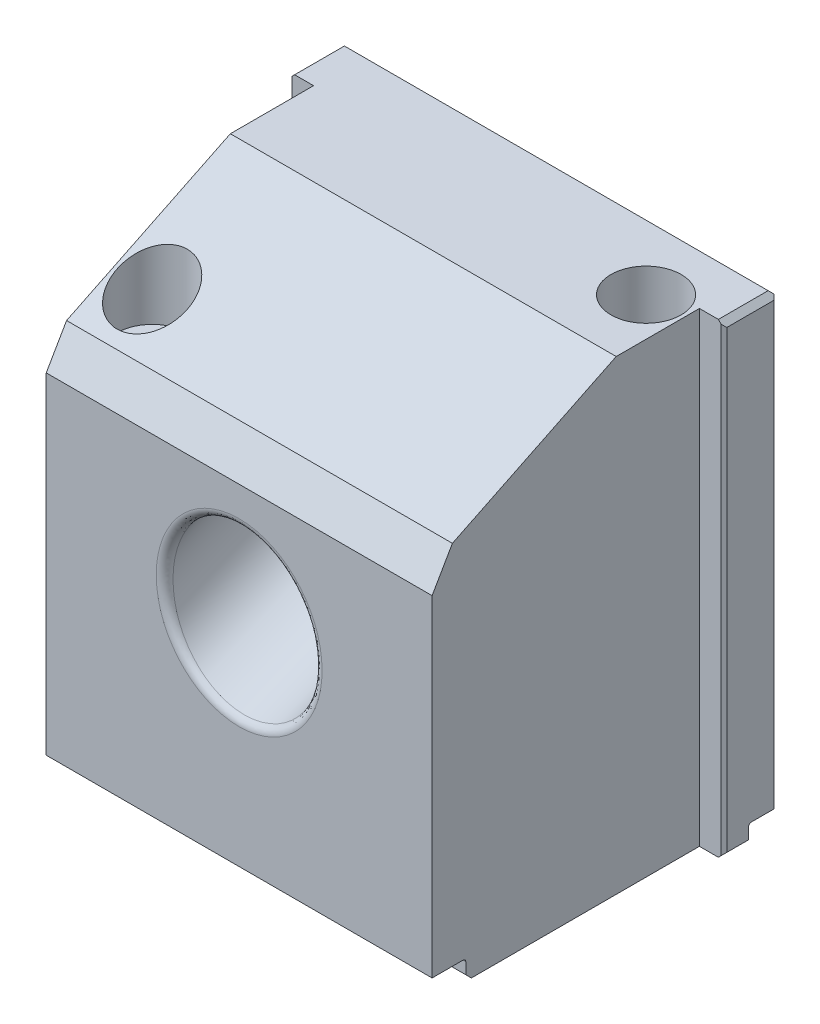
ISO-10303-21;
HEADER;
FILE_DESCRIPTION(('STEP AP214'),'2;1');
FILE_NAME('part.step','',(''),(''),'','','');
FILE_SCHEMA(('AUTOMOTIVE_DESIGN { 1 0 10303 214 1 1 1 1 }'));
ENDSEC;
DATA;
#1=APPLICATION_CONTEXT('core data for automotive mechanical design processes');
#2=APPLICATION_PROTOCOL_DEFINITION('international standard','automotive_design',2000,#1);
#3=PRODUCT_CONTEXT('',#1,'mechanical');
#4=PRODUCT('Part','Part','',(#3));
#5=PRODUCT_RELATED_PRODUCT_CATEGORY('part','',(#4));
#6=PRODUCT_DEFINITION_FORMATION('','',#4);
#7=PRODUCT_DEFINITION_CONTEXT('part definition',#1,'design');
#8=PRODUCT_DEFINITION('design','',#6,#7);
#9=PRODUCT_DEFINITION_SHAPE('','',#8);
#10=(LENGTH_UNIT() NAMED_UNIT(*) SI_UNIT(.MILLI.,.METRE.));
#11=(NAMED_UNIT(*) PLANE_ANGLE_UNIT() SI_UNIT($,.RADIAN.));
#12=(NAMED_UNIT(*) SI_UNIT($,.STERADIAN.) SOLID_ANGLE_UNIT());
#13=UNCERTAINTY_MEASURE_WITH_UNIT(LENGTH_MEASURE(1.E-05),#10,'distance_accuracy_value','');
#14=(GEOMETRIC_REPRESENTATION_CONTEXT(3) GLOBAL_UNCERTAINTY_ASSIGNED_CONTEXT((#13)) GLOBAL_UNIT_ASSIGNED_CONTEXT((#10,
#11,#12)) REPRESENTATION_CONTEXT('',''));
#15=CARTESIAN_POINT('',(0.,0.,0.));
#16=DIRECTION('',(0.,0.,1.));
#17=DIRECTION('',(1.,0.,0.));
#18=AXIS2_PLACEMENT_3D('',#15,#16,#17);
#19=CARTESIAN_POINT('',(-10.541,11.43,-21.336));
#20=DIRECTION('',(0.,0.,1.));
#21=DIRECTION('',(1.,0.,0.));
#22=AXIS2_PLACEMENT_3D('',#19,#20,#21);
#23=PLANE('',#22);
#24=CARTESIAN_POINT('',(-10.541,11.43,-21.336));
#25=DIRECTION('',(0.,0.,1.));
#26=DIRECTION('',(1.,0.,0.));
#27=AXIS2_PLACEMENT_3D('',#24,#25,#26);
#28=CIRCLE('',#27,6.35);
#29=CARTESIAN_POINT('',(-4.191,11.43,-21.336));
#30=VERTEX_POINT('',#29);
#31=EDGE_CURVE('E338',#30,#30,#28,.T.);
#32=ORIENTED_EDGE('',*,*,#31,.F.);
#33=EDGE_LOOP('',(#32));
#34=FACE_BOUND('',#33,.T.);
#35=CARTESIAN_POINT('',(-10.541,15.24,-21.336));
#36=DIRECTION('',(0.,0.,1.));
#37=DIRECTION('',(1.,0.,0.));
#38=AXIS2_PLACEMENT_3D('',#35,#36,#37);
#39=CIRCLE('',#38,0.889);
#40=CARTESIAN_POINT('',(-9.652,15.24,-21.336));
#41=VERTEX_POINT('',#40);
#42=EDGE_CURVE('E342',#41,#41,#39,.T.);
#43=ORIENTED_EDGE('',*,*,#42,.T.);
#44=EDGE_LOOP('',(#43));
#45=FACE_BOUND('',#44,.T.);
#46=DIRECTION('',(-0.999999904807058,-0.000436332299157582,0.));
#47=VECTOR('',#46,1.);
#48=CARTESIAN_POINT('',(-11.6331998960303,15.2395234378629,-21.336));
#49=LINE('',#48,#47);
#50=CARTESIAN_POINT('',(-11.6334538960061,15.2395233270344,-21.336));
#51=VERTEX_POINT('',#50);
#52=CARTESIAN_POINT('',(-11.6331998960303,15.2395234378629,-21.336));
#53=VERTEX_POINT('',#52);
#54=EDGE_CURVE('E293',#51,#53,#49,.F.);
#55=ORIENTED_EDGE('',*,*,#54,.F.);
#56=CARTESIAN_POINT('',(-10.541,15.24,-21.336));
#57=DIRECTION('',(0.,0.,-1.));
#58=DIRECTION('',(-1.,0.,0.));
#59=AXIS2_PLACEMENT_3D('',#56,#57,#58);
#60=CIRCLE('',#59,1.092454);
#61=CARTESIAN_POINT('',(-11.633454,15.24,-21.336));
#62=VERTEX_POINT('',#61);
#63=EDGE_CURVE('E1346',#62,#51,#60,.T.);
#64=ORIENTED_EDGE('',*,*,#63,.F.);
#65=DIRECTION('',(-1.,0.,0.));
#66=VECTOR('',#65,1.);
#67=CARTESIAN_POINT('',(-11.6332,15.24,-21.336));
#68=LINE('',#67,#66);
#69=CARTESIAN_POINT('',(-11.6332,15.24,-21.336));
#70=VERTEX_POINT('',#69);
#71=EDGE_CURVE('E31',#62,#70,#68,.F.);
#72=ORIENTED_EDGE('',*,*,#71,.T.);
#73=CARTESIAN_POINT('',(-10.541,15.24,-21.336));
#74=DIRECTION('',(0.,0.,-1.));
#75=DIRECTION('',(-1.,0.,0.));
#76=AXIS2_PLACEMENT_3D('',#73,#74,#75);
#77=CIRCLE('',#76,1.0922);
#78=EDGE_CURVE('E1359',#70,#53,#77,.T.);
#79=ORIENTED_EDGE('',*,*,#78,.T.);
#80=EDGE_LOOP('',(#55,#64,#72,#79));
#81=FACE_BOUND('',#80,.T.);
#82=ADVANCED_FACE('F16',(#34,#45,#81),#23,.F.);
#83=CARTESIAN_POINT('',(-19.685,40.386,-28.956));
#84=DIRECTION('',(0.,0.,-1.));
#85=DIRECTION('',(-1.,0.,0.));
#86=AXIS2_PLACEMENT_3D('',#83,#84,#85);
#87=PLANE('',#86);
#88=DIRECTION('',(-1.,0.,0.));
#89=VECTOR('',#88,1.);
#90=CARTESIAN_POINT('',(128.522888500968,1.778,-28.956));
#91=LINE('',#90,#89);
#92=CARTESIAN_POINT('',(-9.525,1.778,-28.956));
#93=VERTEX_POINT('',#92);
#94=CARTESIAN_POINT('',(-19.431,1.778,-28.956));
#95=VERTEX_POINT('',#94);
#96=EDGE_CURVE('E349',#93,#95,#91,.T.);
#97=ORIENTED_EDGE('',*,*,#96,.T.);
#98=DIRECTION('',(0.,1.,0.));
#99=VECTOR('',#98,1.);
#100=CARTESIAN_POINT('',(-19.431,40.386,-28.956));
#101=LINE('',#100,#99);
#102=CARTESIAN_POINT('',(-19.431,41.91,-28.956));
#103=VERTEX_POINT('',#102);
#104=EDGE_CURVE('E692',#95,#103,#101,.T.);
#105=ORIENTED_EDGE('',*,*,#104,.T.);
#106=DIRECTION('',(1.,0.,0.));
#107=VECTOR('',#106,1.);
#108=CARTESIAN_POINT('',(-9.525,41.91,-28.956));
#109=LINE('',#108,#107);
#110=CARTESIAN_POINT('',(-9.525,41.91,-28.956));
#111=VERTEX_POINT('',#110);
#112=EDGE_CURVE('E725',#103,#111,#109,.T.);
#113=ORIENTED_EDGE('',*,*,#112,.T.);
#114=DIRECTION('',(0.,-1.,0.));
#115=VECTOR('',#114,1.);
#116=CARTESIAN_POINT('',(-9.525,21.082,-28.956));
#117=LINE('',#116,#115);
#118=CARTESIAN_POINT('',(-9.525,17.6981930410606,-28.956));
#119=VERTEX_POINT('',#118);
#120=EDGE_CURVE('E300',#111,#119,#117,.T.);
#121=ORIENTED_EDGE('',*,*,#120,.T.);
#122=CARTESIAN_POINT('',(-10.541,11.43,-28.956));
#123=DIRECTION('',(0.,0.,-1.));
#124=DIRECTION('',(-1.,0.,0.));
#125=AXIS2_PLACEMENT_3D('',#122,#123,#124);
#126=CIRCLE('',#125,6.35);
#127=CARTESIAN_POINT('',(-9.525,5.16180695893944,-28.956));
#128=VERTEX_POINT('',#127);
#129=EDGE_CURVE('E341',#128,#119,#126,.T.);
#130=ORIENTED_EDGE('',*,*,#129,.F.);
#131=DIRECTION('',(0.,1.,0.));
#132=VECTOR('',#131,1.);
#133=CARTESIAN_POINT('',(-9.525,40.386,-28.956));
#134=LINE('',#133,#132);
#135=EDGE_CURVE('E420',#93,#128,#134,.T.);
#136=ORIENTED_EDGE('',*,*,#135,.F.);
#137=EDGE_LOOP('',(#97,#105,#113,#121,#130,#136));
#138=FACE_BOUND('',#137,.T.);
#139=ADVANCED_FACE('F484',(#138),#87,.T.);
#140=CARTESIAN_POINT('',(128.522888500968,1.778,0.));
#141=DIRECTION('',(0.,1.,0.));
#142=DIRECTION('',(0.,0.,1.));
#143=AXIS2_PLACEMENT_3D('',#140,#141,#142);
#144=PLANE('',#143);
#145=DIRECTION('',(0.,0.,-1.));
#146=VECTOR('',#145,1.);
#147=CARTESIAN_POINT('',(-17.4625,1.778,0.));
#148=LINE('',#147,#146);
#149=CARTESIAN_POINT('',(-17.4625,1.778,0.));
#150=VERTEX_POINT('',#149);
#151=CARTESIAN_POINT('',(-17.4625,1.778,-2.794));
#152=VERTEX_POINT('',#151);
#153=EDGE_CURVE('E352',#150,#152,#148,.T.);
#154=ORIENTED_EDGE('',*,*,#153,.T.);
#155=DIRECTION('',(-1.,0.,0.));
#156=VECTOR('',#155,1.);
#157=CARTESIAN_POINT('',(17.4625,1.778,-2.794));
#158=LINE('',#157,#156);
#159=CARTESIAN_POINT('',(17.4625,1.778,-2.794));
#160=VERTEX_POINT('',#159);
#161=EDGE_CURVE('E631',#152,#160,#158,.F.);
#162=ORIENTED_EDGE('',*,*,#161,.T.);
#163=DIRECTION('',(0.,0.,1.));
#164=VECTOR('',#163,1.);
#165=CARTESIAN_POINT('',(17.4625,1.778,-24.19604));
#166=LINE('',#165,#164);
#167=CARTESIAN_POINT('',(17.4625,1.778,0.));
#168=VERTEX_POINT('',#167);
#169=EDGE_CURVE('E355',#160,#168,#166,.T.);
#170=ORIENTED_EDGE('',*,*,#169,.T.);
#171=DIRECTION('',(-1.,0.,0.));
#172=VECTOR('',#171,1.);
#173=CARTESIAN_POINT('',(128.522888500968,1.778,0.));
#174=LINE('',#173,#172);
#175=EDGE_CURVE('E343',#168,#150,#174,.T.);
#176=ORIENTED_EDGE('',*,*,#175,.T.);
#177=EDGE_LOOP('',(#154,#162,#170,#176));
#178=FACE_BOUND('',#177,.T.);
#179=ADVANCED_FACE('F490',(#178),#144,.F.);
#180=CARTESIAN_POINT('',(128.522888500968,1.778,-3.048));
#181=DIRECTION('',(0.,0.,-1.));
#182=DIRECTION('',(-1.,0.,0.));
#183=AXIS2_PLACEMENT_3D('',#180,#181,#182);
#184=PLANE('',#183);
#185=DIRECTION('',(0.,-1.,0.));
#186=VECTOR('',#185,1.);
#187=CARTESIAN_POINT('',(-17.4625,40.386,-3.048));
#188=LINE('',#187,#186);
#189=CARTESIAN_POINT('',(-17.4625,1.524,-3.048));
#190=VERTEX_POINT('',#189);
#191=CARTESIAN_POINT('',(-17.4625,0.508,-3.048));
#192=VERTEX_POINT('',#191);
#193=EDGE_CURVE('E400',#190,#192,#188,.T.);
#194=ORIENTED_EDGE('',*,*,#193,.T.);
#195=DIRECTION('',(1.,0.,0.));
#196=VECTOR('',#195,1.);
#197=CARTESIAN_POINT('',(17.4625,0.508,-3.048));
#198=LINE('',#197,#196);
#199=CARTESIAN_POINT('',(17.4625,0.508000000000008,-3.048));
#200=VERTEX_POINT('',#199);
#201=EDGE_CURVE('E39',#192,#200,#198,.T.);
#202=ORIENTED_EDGE('',*,*,#201,.T.);
#203=DIRECTION('',(0.,1.,0.));
#204=VECTOR('',#203,1.);
#205=CARTESIAN_POINT('',(17.4625,40.386,-3.048));
#206=LINE('',#205,#204);
#207=CARTESIAN_POINT('',(17.4625,1.524,-3.048));
#208=VERTEX_POINT('',#207);
#209=EDGE_CURVE('E357',#200,#208,#206,.T.);
#210=ORIENTED_EDGE('',*,*,#209,.T.);
#211=DIRECTION('',(-1.,0.,0.));
#212=VECTOR('',#211,1.);
#213=CARTESIAN_POINT('',(-17.4625,1.524,-3.048));
#214=LINE('',#213,#212);
#215=EDGE_CURVE('E627',#208,#190,#214,.T.);
#216=ORIENTED_EDGE('',*,*,#215,.T.);
#217=EDGE_LOOP('',(#194,#202,#210,#216));
#218=FACE_BOUND('',#217,.T.);
#219=ADVANCED_FACE('F505',(#218),#184,.F.);
#220=CARTESIAN_POINT('',(-19.685,40.386,-24.19604));
#221=DIRECTION('',(-1.,0.,0.));
#222=DIRECTION('',(0.,0.,1.));
#223=AXIS2_PLACEMENT_3D('',#220,#221,#222);
#224=PLANE('',#223);
#225=DIRECTION('',(0.,0.,-1.));
#226=VECTOR('',#225,1.);
#227=CARTESIAN_POINT('',(-19.685,41.656,-28.702));
#228=LINE('',#227,#226);
#229=CARTESIAN_POINT('',(-19.685,41.656,-24.45004));
#230=VERTEX_POINT('',#229);
#231=CARTESIAN_POINT('',(-19.685,41.656,-28.702));
#232=VERTEX_POINT('',#231);
#233=EDGE_CURVE('E655',#230,#232,#228,.T.);
#234=ORIENTED_EDGE('',*,*,#233,.T.);
#235=DIRECTION('',(0.,-1.,0.));
#236=VECTOR('',#235,1.);
#237=CARTESIAN_POINT('',(-19.685,40.386,-28.702));
#238=LINE('',#237,#236);
#239=CARTESIAN_POINT('',(-19.685,1.778,-28.702));
#240=VERTEX_POINT('',#239);
#241=EDGE_CURVE('E689',#232,#240,#238,.T.);
#242=ORIENTED_EDGE('',*,*,#241,.T.);
#243=DIRECTION('',(0.,0.,-1.));
#244=VECTOR('',#243,1.);
#245=CARTESIAN_POINT('',(-19.685,1.778,-24.19604));
#246=LINE('',#245,#244);
#247=CARTESIAN_POINT('',(-19.685,1.778,-26.67));
#248=VERTEX_POINT('',#247);
#249=EDGE_CURVE('E370',#248,#240,#246,.T.);
#250=ORIENTED_EDGE('',*,*,#249,.F.);
#251=CARTESIAN_POINT('',(-19.685,1.524,-26.67));
#252=DIRECTION('',(-1.,0.,0.));
#253=DIRECTION('',(0.,0.,1.));
#254=AXIS2_PLACEMENT_3D('',#251,#252,#253);
#255=CIRCLE('',#254,0.254);
#256=CARTESIAN_POINT('',(-19.685,1.524,-26.416));
#257=VERTEX_POINT('',#256);
#258=EDGE_CURVE('E639',#248,#257,#255,.F.);
#259=ORIENTED_EDGE('',*,*,#258,.T.);
#260=DIRECTION('',(0.,1.,0.));
#261=VECTOR('',#260,1.);
#262=CARTESIAN_POINT('',(-19.685,40.386,-26.416));
#263=LINE('',#262,#261);
#264=CARTESIAN_POINT('',(-19.685,0.508,-26.416));
#265=VERTEX_POINT('',#264);
#266=EDGE_CURVE('E376',#265,#257,#263,.T.);
#267=ORIENTED_EDGE('',*,*,#266,.F.);
#268=DIRECTION('',(0.,0.,1.));
#269=VECTOR('',#268,1.);
#270=CARTESIAN_POINT('',(-19.685,0.508,-24.19604));
#271=LINE('',#270,#269);
#272=CARTESIAN_POINT('',(-19.685,0.508,-24.45004));
#273=VERTEX_POINT('',#272);
#274=EDGE_CURVE('E554',#265,#273,#271,.T.);
#275=ORIENTED_EDGE('',*,*,#274,.T.);
#276=DIRECTION('',(0.,1.,0.));
#277=VECTOR('',#276,1.);
#278=CARTESIAN_POINT('',(-19.685,40.386,-24.45004));
#279=LINE('',#278,#277);
#280=EDGE_CURVE('E687',#273,#230,#279,.T.);
#281=ORIENTED_EDGE('',*,*,#280,.T.);
#282=EDGE_LOOP('',(#234,#242,#250,#259,#267,#275,#281));
#283=FACE_BOUND('',#282,.T.);
#284=ADVANCED_FACE('F508',(#283),#224,.T.);
#285=CARTESIAN_POINT('',(19.685,40.386,-28.956));
#286=DIRECTION('',(1.,0.,0.));
#287=DIRECTION('',(0.,0.,-1.));
#288=AXIS2_PLACEMENT_3D('',#285,#286,#287);
#289=PLANE('',#288);
#290=DIRECTION('',(0.,0.,1.));
#291=VECTOR('',#290,1.);
#292=CARTESIAN_POINT('',(19.685,1.778,-28.956));
#293=LINE('',#292,#291);
#294=CARTESIAN_POINT('',(19.685,1.778,-28.702));
#295=VERTEX_POINT('',#294);
#296=CARTESIAN_POINT('',(19.685,1.778,-26.67));
#297=VERTEX_POINT('',#296);
#298=EDGE_CURVE('E368',#295,#297,#293,.T.);
#299=ORIENTED_EDGE('',*,*,#298,.F.);
#300=DIRECTION('',(0.,1.,0.));
#301=VECTOR('',#300,1.);
#302=CARTESIAN_POINT('',(19.685,40.386,-28.702));
#303=LINE('',#302,#301);
#304=CARTESIAN_POINT('',(19.685,41.656,-28.702));
#305=VERTEX_POINT('',#304);
#306=EDGE_CURVE('E677',#295,#305,#303,.T.);
#307=ORIENTED_EDGE('',*,*,#306,.T.);
#308=DIRECTION('',(0.,0.,1.));
#309=VECTOR('',#308,1.);
#310=CARTESIAN_POINT('',(19.685,41.656,-24.19604));
#311=LINE('',#310,#309);
#312=CARTESIAN_POINT('',(19.685,41.656,-24.45004));
#313=VERTEX_POINT('',#312);
#314=EDGE_CURVE('E620',#305,#313,#311,.T.);
#315=ORIENTED_EDGE('',*,*,#314,.T.);
#316=DIRECTION('',(0.,-1.,0.));
#317=VECTOR('',#316,1.);
#318=CARTESIAN_POINT('',(19.685,40.386,-24.45004));
#319=LINE('',#318,#317);
#320=CARTESIAN_POINT('',(19.685,0.508,-24.45004));
#321=VERTEX_POINT('',#320);
#322=EDGE_CURVE('E619',#313,#321,#319,.T.);
#323=ORIENTED_EDGE('',*,*,#322,.T.);
#324=DIRECTION('',(0.,0.,-1.));
#325=VECTOR('',#324,1.);
#326=CARTESIAN_POINT('',(19.685,0.508,-28.956));
#327=LINE('',#326,#325);
#328=CARTESIAN_POINT('',(19.685,0.508000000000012,-26.416));
#329=VERTEX_POINT('',#328);
#330=EDGE_CURVE('E610',#321,#329,#327,.T.);
#331=ORIENTED_EDGE('',*,*,#330,.T.);
#332=DIRECTION('',(0.,-1.,0.));
#333=VECTOR('',#332,1.);
#334=CARTESIAN_POINT('',(19.685,40.386,-26.416));
#335=LINE('',#334,#333);
#336=CARTESIAN_POINT('',(19.685,1.524,-26.416));
#337=VERTEX_POINT('',#336);
#338=EDGE_CURVE('E373',#337,#329,#335,.T.);
#339=ORIENTED_EDGE('',*,*,#338,.F.);
#340=CARTESIAN_POINT('',(19.685,1.524,-26.67));
#341=DIRECTION('',(1.,0.,0.));
#342=DIRECTION('',(0.,0.,-1.));
#343=AXIS2_PLACEMENT_3D('',#340,#341,#342);
#344=CIRCLE('',#343,0.254);
#345=EDGE_CURVE('E641',#337,#297,#344,.F.);
#346=ORIENTED_EDGE('',*,*,#345,.T.);
#347=EDGE_LOOP('',(#299,#307,#315,#323,#331,#339,#346));
#348=FACE_BOUND('',#347,.T.);
#349=ADVANCED_FACE('F526',(#348),#289,.T.);
#350=CARTESIAN_POINT('',(17.4625,0.,-24.19604));
#351=DIRECTION('',(0.,-1.,0.));
#352=DIRECTION('',(0.,0.,-1.));
#353=AXIS2_PLACEMENT_3D('',#350,#351,#352);
#354=PLANE('',#353);
#355=DIRECTION('',(0.,0.,1.));
#356=VECTOR('',#355,1.);
#357=CARTESIAN_POINT('',(17.4625,0.,-24.19604));
#358=LINE('',#357,#356);
#359=CARTESIAN_POINT('',(17.4625,0.,-24.19604));
#360=VERTEX_POINT('',#359);
#361=CARTESIAN_POINT('',(17.4625,0.,-3.556));
#362=VERTEX_POINT('',#361);
#363=EDGE_CURVE('E378',#360,#362,#358,.T.);
#364=ORIENTED_EDGE('',*,*,#363,.T.);
#365=DIRECTION('',(-1.,0.,0.));
#366=VECTOR('',#365,1.);
#367=CARTESIAN_POINT('',(-17.4625,0.,-3.556));
#368=LINE('',#367,#366);
#369=CARTESIAN_POINT('',(-17.4625,0.,-3.556));
#370=VERTEX_POINT('',#369);
#371=EDGE_CURVE('E579',#362,#370,#368,.T.);
#372=ORIENTED_EDGE('',*,*,#371,.T.);
#373=DIRECTION('',(0.,0.,-1.));
#374=VECTOR('',#373,1.);
#375=CARTESIAN_POINT('',(-17.4625,0.,0.));
#376=LINE('',#375,#374);
#377=CARTESIAN_POINT('',(-17.4625,0.,-24.19604));
#378=VERTEX_POINT('',#377);
#379=EDGE_CURVE('E379',#370,#378,#376,.T.);
#380=ORIENTED_EDGE('',*,*,#379,.T.);
#381=DIRECTION('',(-1.,0.,0.));
#382=VECTOR('',#381,1.);
#383=CARTESIAN_POINT('',(-17.4625,0.,-24.19604));
#384=LINE('',#383,#382);
#385=CARTESIAN_POINT('',(-19.177,0.,-24.19604));
#386=VERTEX_POINT('',#385);
#387=EDGE_CURVE('E381',#378,#386,#384,.T.);
#388=ORIENTED_EDGE('',*,*,#387,.T.);
#389=DIRECTION('',(0.,0.,-1.));
#390=VECTOR('',#389,1.);
#391=CARTESIAN_POINT('',(-19.177,0.,-24.19604));
#392=LINE('',#391,#390);
#393=CARTESIAN_POINT('',(-19.177,0.,-25.908));
#394=VERTEX_POINT('',#393);
#395=EDGE_CURVE('E593',#386,#394,#392,.T.);
#396=ORIENTED_EDGE('',*,*,#395,.T.);
#397=DIRECTION('',(1.,0.,0.));
#398=VECTOR('',#397,1.);
#399=CARTESIAN_POINT('',(19.177,0.,-25.908));
#400=LINE('',#399,#398);
#401=CARTESIAN_POINT('',(19.177,0.,-25.908));
#402=VERTEX_POINT('',#401);
#403=EDGE_CURVE('E565',#394,#402,#400,.T.);
#404=ORIENTED_EDGE('',*,*,#403,.T.);
#405=DIRECTION('',(0.,0.,1.));
#406=VECTOR('',#405,1.);
#407=CARTESIAN_POINT('',(19.177,0.,-24.19604));
#408=LINE('',#407,#406);
#409=CARTESIAN_POINT('',(19.177,0.,-24.19604));
#410=VERTEX_POINT('',#409);
#411=EDGE_CURVE('E602',#402,#410,#408,.T.);
#412=ORIENTED_EDGE('',*,*,#411,.T.);
#413=DIRECTION('',(-1.,0.,0.));
#414=VECTOR('',#413,1.);
#415=CARTESIAN_POINT('',(19.685,0.,-24.19604));
#416=LINE('',#415,#414);
#417=EDGE_CURVE('E384',#410,#360,#416,.T.);
#418=ORIENTED_EDGE('',*,*,#417,.T.);
#419=EDGE_LOOP('',(#364,#372,#380,#388,#396,#404,#412,#418));
#420=FACE_BOUND('',#419,.T.);
#421=CARTESIAN_POINT('',(-13.97,0.,-6.096));
#422=DIRECTION('',(0.,-1.,0.));
#423=DIRECTION('',(0.,0.,-1.));
#424=AXIS2_PLACEMENT_3D('',#421,#422,#423);
#425=CIRCLE('',#424,2.0447);
#426=CARTESIAN_POINT('',(-13.97,0.,-8.1407));
#427=VERTEX_POINT('',#426);
#428=EDGE_CURVE('E414',#427,#427,#425,.T.);
#429=ORIENTED_EDGE('',*,*,#428,.F.);
#430=EDGE_LOOP('',(#429));
#431=FACE_BOUND('',#430,.T.);
#432=CARTESIAN_POINT('',(13.97,0.,-22.86));
#433=DIRECTION('',(0.,-1.,0.));
#434=DIRECTION('',(0.,0.,-1.));
#435=AXIS2_PLACEMENT_3D('',#432,#433,#434);
#436=CIRCLE('',#435,2.0447);
#437=CARTESIAN_POINT('',(13.97,0.,-24.9047));
#438=VERTEX_POINT('',#437);
#439=EDGE_CURVE('E419',#438,#438,#436,.T.);
#440=ORIENTED_EDGE('',*,*,#439,.F.);
#441=EDGE_LOOP('',(#440));
#442=FACE_BOUND('',#441,.T.);
#443=ADVANCED_FACE('F522',(#420,#431,#442),#354,.T.);
#444=CARTESIAN_POINT('',(-17.4625,40.386,-24.19604));
#445=DIRECTION('',(0.,0.,1.));
#446=DIRECTION('',(1.,0.,0.));
#447=AXIS2_PLACEMENT_3D('',#444,#445,#446);
#448=PLANE('',#447);
#449=DIRECTION('',(-0.707106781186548,-0.707106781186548,0.));
#450=VECTOR('',#449,1.);
#451=CARTESIAN_POINT('',(-19.20875,42.13225,-24.19604));
#452=LINE('',#451,#450);
#453=CARTESIAN_POINT('',(-19.177,42.164,-24.19604));
#454=VERTEX_POINT('',#453);
#455=CARTESIAN_POINT('',(-19.431,41.91,-24.19604));
#456=VERTEX_POINT('',#455);
#457=EDGE_CURVE('E545',#454,#456,#452,.T.);
#458=ORIENTED_EDGE('',*,*,#457,.T.);
#459=DIRECTION('',(0.,-1.,0.));
#460=VECTOR('',#459,1.);
#461=CARTESIAN_POINT('',(-19.431,40.386,-24.19604));
#462=LINE('',#461,#460);
#463=CARTESIAN_POINT('',(-19.431,0.254,-24.19604));
#464=VERTEX_POINT('',#463);
#465=EDGE_CURVE('E548',#456,#464,#462,.T.);
#466=ORIENTED_EDGE('',*,*,#465,.T.);
#467=DIRECTION('',(-0.707106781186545,0.70710678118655,0.));
#468=VECTOR('',#467,1.);
#469=CARTESIAN_POINT('',(-38.51275,19.33575,-24.19604));
#470=LINE('',#469,#468);
#471=EDGE_CURVE('E555',#464,#386,#470,.F.);
#472=ORIENTED_EDGE('',*,*,#471,.T.);
#473=ORIENTED_EDGE('',*,*,#387,.F.);
#474=DIRECTION('',(0.,-1.,0.));
#475=VECTOR('',#474,1.);
#476=CARTESIAN_POINT('',(-17.4625,40.386,-24.19604));
#477=LINE('',#476,#475);
#478=CARTESIAN_POINT('',(-17.4625,42.164,-24.19604));
#479=VERTEX_POINT('',#478);
#480=EDGE_CURVE('E392',#479,#378,#477,.T.);
#481=ORIENTED_EDGE('',*,*,#480,.F.);
#482=DIRECTION('',(1.,0.,0.));
#483=VECTOR('',#482,1.);
#484=CARTESIAN_POINT('',(-17.4625,42.164,-24.19604));
#485=LINE('',#484,#483);
#486=EDGE_CURVE('E361',#454,#479,#485,.T.);
#487=ORIENTED_EDGE('',*,*,#486,.F.);
#488=EDGE_LOOP('',(#458,#466,#472,#473,#481,#487));
#489=FACE_BOUND('',#488,.T.);
#490=ADVANCED_FACE('F525',(#489),#448,.T.);
#491=DIRECTION('',(1.,0.,0.));
#492=VECTOR('',#491,1.);
#493=CARTESIAN_POINT('',(19.685,41.91,-28.956));
#494=LINE('',#493,#492);
#495=CARTESIAN_POINT('',(9.525,41.91,-28.956));
#496=VERTEX_POINT('',#495);
#497=CARTESIAN_POINT('',(19.431,41.91,-28.956));
#498=VERTEX_POINT('',#497);
#499=EDGE_CURVE('E634',#496,#498,#494,.T.);
#500=ORIENTED_EDGE('',*,*,#499,.T.);
#501=DIRECTION('',(0.,-1.,0.));
#502=VECTOR('',#501,1.);
#503=CARTESIAN_POINT('',(19.431,40.386,-28.956));
#504=LINE('',#503,#502);
#505=CARTESIAN_POINT('',(19.431,1.778,-28.956));
#506=VERTEX_POINT('',#505);
#507=EDGE_CURVE('E669',#498,#506,#504,.T.);
#508=ORIENTED_EDGE('',*,*,#507,.T.);
#509=CARTESIAN_POINT('',(9.525,1.778,-28.956));
#510=VERTEX_POINT('',#509);
#511=EDGE_CURVE('E350',#506,#510,#91,.T.);
#512=ORIENTED_EDGE('',*,*,#511,.T.);
#513=DIRECTION('',(0.,-1.,0.));
#514=VECTOR('',#513,1.);
#515=CARTESIAN_POINT('',(9.525,21.082,-28.956));
#516=LINE('',#515,#514);
#517=EDGE_CURVE('E302',#496,#510,#516,.T.);
#518=ORIENTED_EDGE('',*,*,#517,.F.);
#519=EDGE_LOOP('',(#500,#508,#512,#518));
#520=FACE_BOUND('',#519,.T.);
#521=ADVANCED_FACE('F493',(#520),#87,.T.);
#522=CARTESIAN_POINT('',(19.685,40.386,-24.19604));
#523=DIRECTION('',(0.,0.,1.));
#524=DIRECTION('',(1.,0.,0.));
#525=AXIS2_PLACEMENT_3D('',#522,#523,#524);
#526=PLANE('',#525);
#527=DIRECTION('',(-0.707106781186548,-0.707106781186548,0.));
#528=VECTOR('',#527,1.);
#529=CARTESIAN_POINT('',(39.624,20.447,-24.19604));
#530=LINE('',#529,#528);
#531=CARTESIAN_POINT('',(19.431,0.254,-24.19604));
#532=VERTEX_POINT('',#531);
#533=EDGE_CURVE('E664',#410,#532,#530,.F.);
#534=ORIENTED_EDGE('',*,*,#533,.T.);
#535=DIRECTION('',(0.,1.,0.));
#536=VECTOR('',#535,1.);
#537=CARTESIAN_POINT('',(19.431,40.386,-24.19604));
#538=LINE('',#537,#536);
#539=CARTESIAN_POINT('',(19.431,41.91,-24.19604));
#540=VERTEX_POINT('',#539);
#541=EDGE_CURVE('E685',#532,#540,#538,.T.);
#542=ORIENTED_EDGE('',*,*,#541,.T.);
#543=DIRECTION('',(-0.707106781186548,0.707106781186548,0.));
#544=VECTOR('',#543,1.);
#545=CARTESIAN_POINT('',(20.32,41.021,-24.19604));
#546=LINE('',#545,#544);
#547=CARTESIAN_POINT('',(19.177,42.164,-24.19604));
#548=VERTEX_POINT('',#547);
#549=EDGE_CURVE('E667',#540,#548,#546,.T.);
#550=ORIENTED_EDGE('',*,*,#549,.T.);
#551=DIRECTION('',(1.,0.,0.));
#552=VECTOR('',#551,1.);
#553=CARTESIAN_POINT('',(19.685,42.164,-24.19604));
#554=LINE('',#553,#552);
#555=CARTESIAN_POINT('',(17.4625,42.164,-24.19604));
#556=VERTEX_POINT('',#555);
#557=EDGE_CURVE('E365',#556,#548,#554,.T.);
#558=ORIENTED_EDGE('',*,*,#557,.F.);
#559=DIRECTION('',(0.,-1.,0.));
#560=VECTOR('',#559,1.);
#561=CARTESIAN_POINT('',(17.4625,40.386,-24.19604));
#562=LINE('',#561,#560);
#563=EDGE_CURVE('E387',#556,#360,#562,.T.);
#564=ORIENTED_EDGE('',*,*,#563,.T.);
#565=ORIENTED_EDGE('',*,*,#417,.F.);
#566=EDGE_LOOP('',(#534,#542,#550,#558,#564,#565));
#567=FACE_BOUND('',#566,.T.);
#568=ADVANCED_FACE('F466',(#567),#526,.T.);
#569=CARTESIAN_POINT('',(17.4625,40.386,-24.19604));
#570=DIRECTION('',(1.,0.,0.));
#571=DIRECTION('',(0.,0.,-1.));
#572=AXIS2_PLACEMENT_3D('',#569,#570,#571);
#573=PLANE('',#572);
#574=ORIENTED_EDGE('',*,*,#209,.F.);
#575=DIRECTION('',(0.,-0.707106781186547,-0.707106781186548));
#576=VECTOR('',#575,1.);
#577=CARTESIAN_POINT('',(17.4625,9.87298,6.31698));
#578=LINE('',#577,#576);
#579=EDGE_CURVE('E585',#200,#362,#578,.T.);
#580=ORIENTED_EDGE('',*,*,#579,.T.);
#581=ORIENTED_EDGE('',*,*,#363,.F.);
#582=ORIENTED_EDGE('',*,*,#563,.F.);
#583=DIRECTION('',(0.,0.,-1.));
#584=VECTOR('',#583,1.);
#585=CARTESIAN_POINT('',(17.4625,42.164,-24.19604));
#586=LINE('',#585,#584);
#587=CARTESIAN_POINT('',(17.4625,42.164,-16.6629471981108));
#588=VERTEX_POINT('',#587);
#589=EDGE_CURVE('E363',#588,#556,#586,.T.);
#590=ORIENTED_EDGE('',*,*,#589,.F.);
#591=DIRECTION('',(0.,0.438371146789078,-0.898794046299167));
#592=VECTOR('',#591,1.);
#593=CARTESIAN_POINT('',(17.4625,44.7904021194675,-22.0478695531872));
#594=LINE('',#593,#592);
#595=CARTESIAN_POINT('',(17.4625,34.9333433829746,-1.83790415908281));
#596=VERTEX_POINT('',#595);
#597=EDGE_CURVE('E359',#596,#588,#594,.T.);
#598=ORIENTED_EDGE('',*,*,#597,.F.);
#599=DIRECTION('',(0.,-0.866025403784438,0.5));
#600=VECTOR('',#599,1.);
#601=CARTESIAN_POINT('',(17.4625,48.7041926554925,-9.7885076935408));
#602=LINE('',#601,#600);
#603=CARTESIAN_POINT('',(17.4625,31.750000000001,0.));
#604=VERTEX_POINT('',#603);
#605=EDGE_CURVE('E803',#596,#604,#602,.T.);
#606=ORIENTED_EDGE('',*,*,#605,.T.);
#607=DIRECTION('',(0.,-1.,0.));
#608=VECTOR('',#607,1.);
#609=CARTESIAN_POINT('',(17.4625,40.386,0.));
#610=LINE('',#609,#608);
#611=EDGE_CURVE('E397',#604,#168,#610,.T.);
#612=ORIENTED_EDGE('',*,*,#611,.T.);
#613=ORIENTED_EDGE('',*,*,#169,.F.);
#614=CARTESIAN_POINT('',(17.4625,1.524,-2.794));
#615=DIRECTION('',(1.,0.,0.));
#616=DIRECTION('',(0.,0.,-1.));
#617=AXIS2_PLACEMENT_3D('',#614,#615,#616);
#618=CIRCLE('',#617,0.254);
#619=EDGE_CURVE('E645',#160,#208,#618,.F.);
#620=ORIENTED_EDGE('',*,*,#619,.T.);
#621=EDGE_LOOP('',(#574,#580,#581,#582,#590,#598,#606,#612,#613,#620));
#622=FACE_BOUND('',#621,.T.);
#623=ADVANCED_FACE('F464',(#622),#573,.T.);
#624=CARTESIAN_POINT('',(-17.4625,40.386,0.));
#625=DIRECTION('',(-1.,0.,0.));
#626=DIRECTION('',(0.,0.,1.));
#627=AXIS2_PLACEMENT_3D('',#624,#625,#626);
#628=PLANE('',#627);
#629=ORIENTED_EDGE('',*,*,#379,.F.);
#630=DIRECTION('',(0.,0.707106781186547,0.707106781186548));
#631=VECTOR('',#630,1.);
#632=CARTESIAN_POINT('',(-17.4625,21.971,18.415));
#633=LINE('',#632,#631);
#634=EDGE_CURVE('E582',#370,#192,#633,.T.);
#635=ORIENTED_EDGE('',*,*,#634,.T.);
#636=ORIENTED_EDGE('',*,*,#193,.F.);
#637=CARTESIAN_POINT('',(-17.4625,1.524,-2.794));
#638=DIRECTION('',(-1.,0.,0.));
#639=DIRECTION('',(0.,0.,1.));
#640=AXIS2_PLACEMENT_3D('',#637,#638,#639);
#641=CIRCLE('',#640,0.254);
#642=EDGE_CURVE('E643',#190,#152,#641,.F.);
#643=ORIENTED_EDGE('',*,*,#642,.T.);
#644=ORIENTED_EDGE('',*,*,#153,.F.);
#645=DIRECTION('',(0.,-1.,0.));
#646=VECTOR('',#645,1.);
#647=CARTESIAN_POINT('',(-17.4625,40.386,0.));
#648=LINE('',#647,#646);
#649=CARTESIAN_POINT('',(-17.4625,31.750000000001,0.));
#650=VERTEX_POINT('',#649);
#651=EDGE_CURVE('E395',#650,#150,#648,.T.);
#652=ORIENTED_EDGE('',*,*,#651,.F.);
#653=DIRECTION('',(0.,0.866025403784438,-0.5));
#654=VECTOR('',#653,1.);
#655=CARTESIAN_POINT('',(-17.4625,38.227,-3.73949769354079));
#656=LINE('',#655,#654);
#657=CARTESIAN_POINT('',(-17.4625,34.9333433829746,-1.8379041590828));
#658=VERTEX_POINT('',#657);
#659=EDGE_CURVE('E797',#650,#658,#656,.T.);
#660=ORIENTED_EDGE('',*,*,#659,.T.);
#661=DIRECTION('',(0.,-0.438371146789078,0.898794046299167));
#662=VECTOR('',#661,1.);
#663=CARTESIAN_POINT('',(-17.4625,35.2570322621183,-2.50156471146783));
#664=LINE('',#663,#662);
#665=CARTESIAN_POINT('',(-17.4625,42.164,-16.6629471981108));
#666=VERTEX_POINT('',#665);
#667=EDGE_CURVE('E402',#666,#658,#664,.T.);
#668=ORIENTED_EDGE('',*,*,#667,.F.);
#669=DIRECTION('',(0.,0.,1.));
#670=VECTOR('',#669,1.);
#671=CARTESIAN_POINT('',(-17.4625,42.164,0.));
#672=LINE('',#671,#670);
#673=EDGE_CURVE('E405',#479,#666,#672,.T.);
#674=ORIENTED_EDGE('',*,*,#673,.F.);
#675=ORIENTED_EDGE('',*,*,#480,.T.);
#676=EDGE_LOOP('',(#629,#635,#636,#643,#644,#652,#660,#668,#674,#675));
#677=FACE_BOUND('',#676,.T.);
#678=ADVANCED_FACE('F461',(#677),#628,.T.);
#679=CARTESIAN_POINT('',(17.4625,40.386,0.));
#680=DIRECTION('',(0.,0.,1.));
#681=DIRECTION('',(1.,0.,0.));
#682=AXIS2_PLACEMENT_3D('',#679,#680,#681);
#683=PLANE('',#682);
#684=ORIENTED_EDGE('',*,*,#611,.F.);
#685=DIRECTION('',(-1.,0.,0.));
#686=VECTOR('',#685,1.);
#687=CARTESIAN_POINT('',(-17.4625,31.750000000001,0.));
#688=LINE('',#687,#686);
#689=EDGE_CURVE('E801',#604,#650,#688,.T.);
#690=ORIENTED_EDGE('',*,*,#689,.T.);
#691=ORIENTED_EDGE('',*,*,#651,.T.);
#692=ORIENTED_EDGE('',*,*,#175,.F.);
#693=EDGE_LOOP('',(#684,#690,#691,#692));
#694=FACE_BOUND('',#693,.T.);
#695=CARTESIAN_POINT('',(0.,20.8980560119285,0.));
#696=DIRECTION('',(0.,0.,1.));
#697=DIRECTION('',(0.,-1.,0.));
#698=AXIS2_PLACEMENT_3D('',#695,#696,#697);
#699=ELLIPSE('',#698,8.15389508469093,7.5057);
#700=CARTESIAN_POINT('',(0.,12.7441609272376,0.));
#701=VERTEX_POINT('',#700);
#702=EDGE_CURVE('E423',#701,#701,#699,.F.);
#703=ORIENTED_EDGE('',*,*,#702,.T.);
#704=EDGE_LOOP('',(#703));
#705=FACE_BOUND('',#704,.T.);
#706=ADVANCED_FACE('F455',(#694,#705),#683,.T.);
#707=CARTESIAN_POINT('',(128.522888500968,42.164,-16.6629471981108));
#708=DIRECTION('',(0.,-0.898794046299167,-0.438371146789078));
#709=DIRECTION('',(0.,0.438371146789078,-0.898794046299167));
#710=AXIS2_PLACEMENT_3D('',#707,#708,#709);
#711=PLANE('',#710);
#712=CARTESIAN_POINT('',(-13.97,37.0101554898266,-6.096));
#713=DIRECTION('',(0.,-0.898794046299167,-0.438371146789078));
#714=DIRECTION('',(0.,-0.438371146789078,0.898794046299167));
#715=AXIS2_PLACEMENT_3D('',#712,#713,#714);
#716=ELLIPSE('',#715,3.53251116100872,3.175);
#717=CARTESIAN_POINT('',(-13.97,35.46160452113,-2.921));
#718=VERTEX_POINT('',#717);
#719=EDGE_CURVE('E337',#718,#718,#716,.T.);
#720=ORIENTED_EDGE('',*,*,#719,.T.);
#721=EDGE_LOOP('',(#720));
#722=FACE_BOUND('',#721,.T.);
#723=ORIENTED_EDGE('',*,*,#667,.T.);
#724=DIRECTION('',(1.,0.,0.));
#725=VECTOR('',#724,1.);
#726=CARTESIAN_POINT('',(17.4625,34.9333433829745,-1.8379041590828));
#727=LINE('',#726,#725);
#728=EDGE_CURVE('E436',#658,#596,#727,.T.);
#729=ORIENTED_EDGE('',*,*,#728,.T.);
#730=ORIENTED_EDGE('',*,*,#597,.T.);
#731=DIRECTION('',(-1.,0.,0.));
#732=VECTOR('',#731,1.);
#733=CARTESIAN_POINT('',(128.522888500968,42.164,-16.6629471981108));
#734=LINE('',#733,#732);
#735=EDGE_CURVE('E346',#588,#666,#734,.T.);
#736=ORIENTED_EDGE('',*,*,#735,.T.);
#737=EDGE_LOOP('',(#723,#729,#730,#736));
#738=FACE_BOUND('',#737,.T.);
#739=ADVANCED_FACE('F460',(#722,#738),#711,.F.);
#740=CARTESIAN_POINT('',(128.522888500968,42.164,-28.956));
#741=DIRECTION('',(0.,-1.,0.));
#742=DIRECTION('',(0.,0.,-1.));
#743=AXIS2_PLACEMENT_3D('',#740,#741,#742);
#744=PLANE('',#743);
#745=CARTESIAN_POINT('',(13.97,42.164,-22.86));
#746=DIRECTION('',(0.,-1.,0.));
#747=DIRECTION('',(0.,0.,-1.));
#748=AXIS2_PLACEMENT_3D('',#745,#746,#747);
#749=CIRCLE('',#748,3.175);
#750=CARTESIAN_POINT('',(13.97,42.164,-26.035));
#751=VERTEX_POINT('',#750);
#752=EDGE_CURVE('E411',#751,#751,#749,.T.);
#753=ORIENTED_EDGE('',*,*,#752,.T.);
#754=EDGE_LOOP('',(#753));
#755=FACE_BOUND('',#754,.T.);
#756=DIRECTION('',(-1.,0.,0.));
#757=VECTOR('',#756,1.);
#758=CARTESIAN_POINT('',(-19.685,42.164,-28.702));
#759=LINE('',#758,#757);
#760=CARTESIAN_POINT('',(-9.525,42.164,-28.702));
#761=VERTEX_POINT('',#760);
#762=CARTESIAN_POINT('',(-19.177,42.164,-28.702));
#763=VERTEX_POINT('',#762);
#764=EDGE_CURVE('E728',#761,#763,#759,.T.);
#765=ORIENTED_EDGE('',*,*,#764,.T.);
#766=DIRECTION('',(0.,0.,1.));
#767=VECTOR('',#766,1.);
#768=CARTESIAN_POINT('',(-19.177,42.164,-24.19604));
#769=LINE('',#768,#767);
#770=EDGE_CURVE('E651',#763,#454,#769,.T.);
#771=ORIENTED_EDGE('',*,*,#770,.T.);
#772=ORIENTED_EDGE('',*,*,#486,.T.);
#773=ORIENTED_EDGE('',*,*,#673,.T.);
#774=ORIENTED_EDGE('',*,*,#735,.F.);
#775=ORIENTED_EDGE('',*,*,#589,.T.);
#776=ORIENTED_EDGE('',*,*,#557,.T.);
#777=DIRECTION('',(0.,0.,-1.));
#778=VECTOR('',#777,1.);
#779=CARTESIAN_POINT('',(19.177,42.164,-28.702));
#780=LINE('',#779,#778);
#781=CARTESIAN_POINT('',(19.177,42.164,-28.702));
#782=VERTEX_POINT('',#781);
#783=EDGE_CURVE('E648',#548,#782,#780,.T.);
#784=ORIENTED_EDGE('',*,*,#783,.T.);
#785=DIRECTION('',(-1.,0.,0.));
#786=VECTOR('',#785,1.);
#787=CARTESIAN_POINT('',(9.525,42.164,-28.702));
#788=LINE('',#787,#786);
#789=CARTESIAN_POINT('',(9.525,42.164,-28.702));
#790=VERTEX_POINT('',#789);
#791=EDGE_CURVE('E796',#782,#790,#788,.T.);
#792=ORIENTED_EDGE('',*,*,#791,.T.);
#793=DIRECTION('',(-1.,0.,0.));
#794=VECTOR('',#793,1.);
#795=CARTESIAN_POINT('',(128.522888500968,42.164,-28.702));
#796=LINE('',#795,#794);
#797=EDGE_CURVE('E422',#790,#761,#796,.T.);
#798=ORIENTED_EDGE('',*,*,#797,.T.);
#799=EDGE_LOOP('',(#765,#771,#772,#773,#774,#775,#776,#784,#792,#798));
#800=FACE_BOUND('',#799,.T.);
#801=ADVANCED_FACE('F514',(#755,#800),#744,.F.);
#802=CARTESIAN_POINT('',(128.522888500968,1.778,-26.416));
#803=DIRECTION('',(0.,1.,0.));
#804=DIRECTION('',(0.,0.,1.));
#805=AXIS2_PLACEMENT_3D('',#802,#803,#804);
#806=PLANE('',#805);
#807=ORIENTED_EDGE('',*,*,#511,.F.);
#808=DIRECTION('',(-0.707106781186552,0.,-0.707106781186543));
#809=VECTOR('',#808,1.);
#810=CARTESIAN_POINT('',(19.431,1.778,-28.956));
#811=LINE('',#810,#809);
#812=EDGE_CURVE('E674',#506,#295,#811,.F.);
#813=ORIENTED_EDGE('',*,*,#812,.T.);
#814=ORIENTED_EDGE('',*,*,#298,.T.);
#815=DIRECTION('',(-1.,0.,0.));
#816=VECTOR('',#815,1.);
#817=CARTESIAN_POINT('',(-19.685,1.778,-26.67));
#818=LINE('',#817,#816);
#819=EDGE_CURVE('E628',#297,#248,#818,.T.);
#820=ORIENTED_EDGE('',*,*,#819,.T.);
#821=ORIENTED_EDGE('',*,*,#249,.T.);
#822=DIRECTION('',(-0.707106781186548,0.,0.707106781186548));
#823=VECTOR('',#822,1.);
#824=CARTESIAN_POINT('',(-19.685,1.778,-28.702));
#825=LINE('',#824,#823);
#826=EDGE_CURVE('E672',#240,#95,#825,.F.);
#827=ORIENTED_EDGE('',*,*,#826,.T.);
#828=ORIENTED_EDGE('',*,*,#96,.F.);
#829=DIRECTION('',(0.,0.,1.));
#830=VECTOR('',#829,1.);
#831=CARTESIAN_POINT('',(-9.525,1.778,-26.416));
#832=LINE('',#831,#830);
#833=CARTESIAN_POINT('',(-9.525,1.778,-28.702));
#834=VERTEX_POINT('',#833);
#835=EDGE_CURVE('E314',#93,#834,#832,.T.);
#836=ORIENTED_EDGE('',*,*,#835,.T.);
#837=DIRECTION('',(1.,0.,0.));
#838=VECTOR('',#837,1.);
#839=CARTESIAN_POINT('',(128.522888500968,1.778,-28.702));
#840=LINE('',#839,#838);
#841=CARTESIAN_POINT('',(9.525,1.778,-28.702));
#842=VERTEX_POINT('',#841);
#843=EDGE_CURVE('E323',#834,#842,#840,.T.);
#844=ORIENTED_EDGE('',*,*,#843,.T.);
#845=DIRECTION('',(0.,0.,-1.));
#846=VECTOR('',#845,1.);
#847=CARTESIAN_POINT('',(9.525,1.778,-26.416));
#848=LINE('',#847,#846);
#849=EDGE_CURVE('E306',#842,#510,#848,.T.);
#850=ORIENTED_EDGE('',*,*,#849,.T.);
#851=EDGE_LOOP('',(#807,#813,#814,#820,#821,#827,#828,#836,#844,#850));
#852=FACE_BOUND('',#851,.T.);
#853=ADVANCED_FACE('F503',(#852),#806,.F.);
#854=CARTESIAN_POINT('',(128.522888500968,0.,-26.416));
#855=DIRECTION('',(0.,0.,1.));
#856=DIRECTION('',(1.,0.,0.));
#857=AXIS2_PLACEMENT_3D('',#854,#855,#856);
#858=PLANE('',#857);
#859=ORIENTED_EDGE('',*,*,#338,.T.);
#860=DIRECTION('',(-1.,0.,0.));
#861=VECTOR('',#860,1.);
#862=CARTESIAN_POINT('',(-19.177,0.508,-26.416));
#863=LINE('',#862,#861);
#864=EDGE_CURVE('E587',#329,#265,#863,.T.);
#865=ORIENTED_EDGE('',*,*,#864,.T.);
#866=ORIENTED_EDGE('',*,*,#266,.T.);
#867=DIRECTION('',(-1.,0.,0.));
#868=VECTOR('',#867,1.);
#869=CARTESIAN_POINT('',(19.685,1.524,-26.416));
#870=LINE('',#869,#868);
#871=EDGE_CURVE('E624',#257,#337,#870,.F.);
#872=ORIENTED_EDGE('',*,*,#871,.T.);
#873=EDGE_LOOP('',(#859,#865,#866,#872));
#874=FACE_BOUND('',#873,.T.);
#875=ADVANCED_FACE('F500',(#874),#858,.F.);
#876=CARTESIAN_POINT('',(0.,111.648929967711,-214.557661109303));
#877=DIRECTION('',(0.,-0.390731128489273,0.92050485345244));
#878=DIRECTION('',(0.,-0.92050485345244,-0.390731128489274));
#879=AXIS2_PLACEMENT_3D('',#876,#877,#878);
#880=CYLINDRICAL_SURFACE('',#879,6.7437);
#881=CARTESIAN_POINT('',(0.,32.4344325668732,-27.94));
#882=DIRECTION('',(0.,-0.0399196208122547,-0.999202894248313));
#883=DIRECTION('',(0.,-0.999202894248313,0.0399196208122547));
#884=AXIS2_PLACEMENT_3D('',#881,#882,#883);
#885=ELLIPSE('',#884,7.45841553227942,6.7437);
#886=CARTESIAN_POINT('',(0.,24.981962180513,-27.6422628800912));
#887=VERTEX_POINT('',#886);
#888=EDGE_CURVE('E426',#887,#887,#885,.T.);
#889=ORIENTED_EDGE('',*,*,#888,.T.);
#890=EDGE_LOOP('',(#889));
#891=FACE_BOUND('',#890,.T.);
#892=CARTESIAN_POINT('',(0.,20.8980560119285,-0.761999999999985));
#893=DIRECTION('',(0.,-0.0399196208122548,-0.999202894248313));
#894=DIRECTION('',(0.,-0.999202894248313,0.0399196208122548));
#895=AXIS2_PLACEMENT_3D('',#892,#893,#894);
#896=ELLIPSE('',#895,7.45841553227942,6.7437);
#897=CARTESIAN_POINT('',(0.,13.4455856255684,-0.464262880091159));
#898=VERTEX_POINT('',#897);
#899=EDGE_CURVE('E408',#898,#898,#896,.F.);
#900=ORIENTED_EDGE('',*,*,#899,.T.);
#901=EDGE_LOOP('',(#900));
#902=FACE_BOUND('',#901,.T.);
#903=ADVANCED_FACE('F450',(#891,#902),#880,.F.);
#904=CARTESIAN_POINT('',(-10.541,11.43,-254.));
#905=DIRECTION('',(0.,0.,1.));
#906=DIRECTION('',(1.,0.,0.));
#907=AXIS2_PLACEMENT_3D('',#904,#905,#906);
#908=CYLINDRICAL_SURFACE('',#907,6.35);
#909=CARTESIAN_POINT('',(-10.541,11.43,-28.702));
#910=DIRECTION('',(0.,0.,1.));
#911=DIRECTION('',(1.,0.,0.));
#912=AXIS2_PLACEMENT_3D('',#909,#910,#911);
#913=CIRCLE('',#912,6.35);
#914=CARTESIAN_POINT('',(-9.525,17.6981930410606,-28.702));
#915=VERTEX_POINT('',#914);
#916=CARTESIAN_POINT('',(-9.525,5.16180695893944,-28.702));
#917=VERTEX_POINT('',#916);
#918=EDGE_CURVE('E326',#915,#917,#913,.F.);
#919=ORIENTED_EDGE('',*,*,#918,.T.);
#920=DIRECTION('',(0.,0.,1.));
#921=VECTOR('',#920,1.);
#922=CARTESIAN_POINT('',(-9.525,5.16180695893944,-254.));
#923=LINE('',#922,#921);
#924=EDGE_CURVE('E320',#917,#128,#923,.F.);
#925=ORIENTED_EDGE('',*,*,#924,.T.);
#926=ORIENTED_EDGE('',*,*,#129,.T.);
#927=DIRECTION('',(0.,0.,1.));
#928=VECTOR('',#927,1.);
#929=CARTESIAN_POINT('',(-9.525,17.6981930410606,-254.));
#930=LINE('',#929,#928);
#931=EDGE_CURVE('E317',#119,#915,#930,.T.);
#932=ORIENTED_EDGE('',*,*,#931,.T.);
#933=EDGE_LOOP('',(#919,#925,#926,#932));
#934=FACE_BOUND('',#933,.T.);
#935=ORIENTED_EDGE('',*,*,#31,.T.);
#936=EDGE_LOOP('',(#935));
#937=FACE_BOUND('',#936,.T.);
#938=ADVANCED_FACE('F471',(#934,#937),#908,.F.);
#939=CARTESIAN_POINT('',(-10.541,15.24,-254.));
#940=DIRECTION('',(0.,0.,1.));
#941=DIRECTION('',(1.,0.,0.));
#942=AXIS2_PLACEMENT_3D('',#939,#940,#941);
#943=CYLINDRICAL_SURFACE('',#942,0.889);
#944=ORIENTED_EDGE('',*,*,#42,.F.);
#945=EDGE_LOOP('',(#944));
#946=FACE_BOUND('',#945,.T.);
#947=CARTESIAN_POINT('',(-10.541,15.24,-14.605));
#948=DIRECTION('',(0.,0.,1.));
#949=DIRECTION('',(1.,0.,0.));
#950=AXIS2_PLACEMENT_3D('',#947,#948,#949);
#951=CIRCLE('',#950,0.889);
#952=CARTESIAN_POINT('',(-9.652,15.24,-14.605));
#953=VERTEX_POINT('',#952);
#954=EDGE_CURVE('E296',#953,#953,#951,.T.);
#955=ORIENTED_EDGE('',*,*,#954,.T.);
#956=EDGE_LOOP('',(#955));
#957=FACE_BOUND('',#956,.T.);
#958=ADVANCED_FACE('F468',(#946,#957),#943,.F.);
#959=CARTESIAN_POINT('',(13.97,254.,-22.86));
#960=DIRECTION('',(0.,-1.,0.));
#961=DIRECTION('',(0.,0.,-1.));
#962=AXIS2_PLACEMENT_3D('',#959,#960,#961);
#963=CYLINDRICAL_SURFACE('',#962,2.0447);
#964=CARTESIAN_POINT('',(13.97,32.004,-22.86));
#965=DIRECTION('',(0.,-1.,0.));
#966=DIRECTION('',(0.,0.,-1.));
#967=AXIS2_PLACEMENT_3D('',#964,#965,#966);
#968=CIRCLE('',#967,2.0447);
#969=CARTESIAN_POINT('',(13.97,32.004,-24.9047));
#970=VERTEX_POINT('',#969);
#971=EDGE_CURVE('E336',#970,#970,#968,.F.);
#972=ORIENTED_EDGE('',*,*,#971,.T.);
#973=EDGE_LOOP('',(#972));
#974=FACE_BOUND('',#973,.T.);
#975=ORIENTED_EDGE('',*,*,#439,.T.);
#976=EDGE_LOOP('',(#975));
#977=FACE_BOUND('',#976,.T.);
#978=ADVANCED_FACE('F470',(#974,#977),#963,.F.);
#979=CARTESIAN_POINT('',(-13.97,254.,-6.096));
#980=DIRECTION('',(0.,-1.,0.));
#981=DIRECTION('',(0.,0.,-1.));
#982=AXIS2_PLACEMENT_3D('',#979,#980,#981);
#983=CYLINDRICAL_SURFACE('',#982,2.0447);
#984=CARTESIAN_POINT('',(-13.97,32.004,-6.096));
#985=DIRECTION('',(0.,-1.,0.));
#986=DIRECTION('',(0.,0.,-1.));
#987=AXIS2_PLACEMENT_3D('',#984,#985,#986);
#988=CIRCLE('',#987,2.0447);
#989=CARTESIAN_POINT('',(-13.97,32.004,-8.1407));
#990=VERTEX_POINT('',#989);
#991=EDGE_CURVE('E332',#990,#990,#988,.F.);
#992=ORIENTED_EDGE('',*,*,#991,.T.);
#993=EDGE_LOOP('',(#992));
#994=FACE_BOUND('',#993,.T.);
#995=ORIENTED_EDGE('',*,*,#428,.T.);
#996=EDGE_LOOP('',(#995));
#997=FACE_BOUND('',#996,.T.);
#998=ADVANCED_FACE('F18',(#994,#997),#983,.F.);
#999=CARTESIAN_POINT('',(13.97,254.,-22.86));
#1000=DIRECTION('',(0.,-1.,0.));
#1001=DIRECTION('',(0.,0.,-1.));
#1002=AXIS2_PLACEMENT_3D('',#999,#1000,#1001);
#1003=CYLINDRICAL_SURFACE('',#1002,3.175);
#1004=CARTESIAN_POINT('',(13.97,32.004,-22.86));
#1005=DIRECTION('',(0.,-1.,0.));
#1006=DIRECTION('',(1.,0.,0.));
#1007=AXIS2_PLACEMENT_3D('',#1004,#1005,#1006);
#1008=CIRCLE('',#1007,3.175);
#1009=CARTESIAN_POINT('',(17.145,32.004,-22.86));
#1010=VERTEX_POINT('',#1009);
#1011=EDGE_CURVE('E333',#1010,#1010,#1008,.T.);
#1012=ORIENTED_EDGE('',*,*,#1011,.T.);
#1013=EDGE_LOOP('',(#1012));
#1014=FACE_BOUND('',#1013,.T.);
#1015=ORIENTED_EDGE('',*,*,#752,.F.);
#1016=EDGE_LOOP('',(#1015));
#1017=FACE_BOUND('',#1016,.T.);
#1018=ADVANCED_FACE('F497',(#1014,#1017),#1003,.F.);
#1019=CARTESIAN_POINT('',(13.97,32.004,-22.86));
#1020=DIRECTION('',(0.,-1.,0.));
#1021=DIRECTION('',(0.,0.,-1.));
#1022=AXIS2_PLACEMENT_3D('',#1019,#1020,#1021);
#1023=PLANE('',#1022);
#1024=ORIENTED_EDGE('',*,*,#1011,.F.);
#1025=EDGE_LOOP('',(#1024));
#1026=FACE_BOUND('',#1025,.T.);
#1027=ORIENTED_EDGE('',*,*,#971,.F.);
#1028=EDGE_LOOP('',(#1027));
#1029=FACE_BOUND('',#1028,.T.);
#1030=ADVANCED_FACE('F778',(#1026,#1029),#1023,.F.);
#1031=CARTESIAN_POINT('',(-13.97,254.,-6.096));
#1032=DIRECTION('',(0.,-1.,0.));
#1033=DIRECTION('',(0.,0.,-1.));
#1034=AXIS2_PLACEMENT_3D('',#1031,#1032,#1033);
#1035=CYLINDRICAL_SURFACE('',#1034,3.175);
#1036=CARTESIAN_POINT('',(-13.97,32.004,-6.096));
#1037=DIRECTION('',(0.,-1.,0.));
#1038=DIRECTION('',(1.,0.,0.));
#1039=AXIS2_PLACEMENT_3D('',#1036,#1037,#1038);
#1040=CIRCLE('',#1039,3.175);
#1041=CARTESIAN_POINT('',(-10.795,32.004,-6.096));
#1042=VERTEX_POINT('',#1041);
#1043=EDGE_CURVE('E329',#1042,#1042,#1040,.T.);
#1044=ORIENTED_EDGE('',*,*,#1043,.T.);
#1045=EDGE_LOOP('',(#1044));
#1046=FACE_BOUND('',#1045,.T.);
#1047=ORIENTED_EDGE('',*,*,#719,.F.);
#1048=EDGE_LOOP('',(#1047));
#1049=FACE_BOUND('',#1048,.T.);
#1050=ADVANCED_FACE('F775',(#1046,#1049),#1035,.F.);
#1051=CARTESIAN_POINT('',(-13.97,32.004,-6.096));
#1052=DIRECTION('',(0.,-1.,0.));
#1053=DIRECTION('',(0.,0.,-1.));
#1054=AXIS2_PLACEMENT_3D('',#1051,#1052,#1053);
#1055=PLANE('',#1054);
#1056=ORIENTED_EDGE('',*,*,#1043,.F.);
#1057=EDGE_LOOP('',(#1056));
#1058=FACE_BOUND('',#1057,.T.);
#1059=ORIENTED_EDGE('',*,*,#991,.F.);
#1060=EDGE_LOOP('',(#1059));
#1061=FACE_BOUND('',#1060,.T.);
#1062=ADVANCED_FACE('F448',(#1058,#1061),#1055,.F.);
#1063=CARTESIAN_POINT('',(0.,12.7441609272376,0.));
#1064=CARTESIAN_POINT('',(0.,13.2485177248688,0.));
#1065=CARTESIAN_POINT('',(0.,13.4455856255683,-0.464262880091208));
#1066=CARTESIAN_POINT('',(0.327664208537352,12.7441609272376,0.));
#1067=CARTESIAN_POINT('',(0.303743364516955,13.2485177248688,0.));
#1068=CARTESIAN_POINT('',(0.294398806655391,13.4455856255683,-0.464262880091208));
#1069=CARTESIAN_POINT('',(0.6553284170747,12.7675282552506,0.));
#1070=CARTESIAN_POINT('',(0.607731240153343,13.2708841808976,0.));
#1071=CARTESIAN_POINT('',(0.588797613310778,13.466942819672,-0.465116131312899));
#1072=CARTESIAN_POINT('',(1.30503739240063,12.8604498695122,0.));
#1073=CARTESIAN_POINT('',(1.20966643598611,13.3596523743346,0.));
#1074=CARTESIAN_POINT('',(1.17254628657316,13.5518710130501,-0.468509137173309));
#1075=CARTESIAN_POINT('',(1.62706207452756,12.9301441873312,0.));
#1076=CARTESIAN_POINT('',(1.50806331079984,13.4263297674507,0.));
#1077=CARTESIAN_POINT('',(1.46187810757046,13.6155699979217,-0.471054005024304));
#1078=CARTESIAN_POINT('',(2.26001147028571,13.1143869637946,0.));
#1079=CARTESIAN_POINT('',(2.09344800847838,13.6022192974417,0.));
#1080=CARTESIAN_POINT('',(2.03056868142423,13.7839636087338,-0.477781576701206));
#1081=CARTESIAN_POINT('',(2.57086063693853,13.2291942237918,0.));
#1082=CARTESIAN_POINT('',(2.38077362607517,13.7119509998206,0.));
#1083=CARTESIAN_POINT('',(2.30985955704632,13.8888947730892,-0.481973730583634));
#1084=CARTESIAN_POINT('',(3.17620416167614,13.5015870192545,0.));
#1085=CARTESIAN_POINT('',(2.93891924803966,13.9716977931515,0.));
#1086=CARTESIAN_POINT('',(2.85374688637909,14.1378554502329,-0.491920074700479));
#1087=CARTESIAN_POINT('',(3.47054501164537,13.6595127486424,0.));
#1088=CARTESIAN_POINT('',(3.20991103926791,14.1224194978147,0.));
#1089=CARTESIAN_POINT('',(3.11820541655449,14.2821958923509,-0.497686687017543));
#1090=CARTESIAN_POINT('',(4.03791846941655,14.0153719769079,0.));
#1091=CARTESIAN_POINT('',(3.73064018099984,14.4612006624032,0.));
#1092=CARTESIAN_POINT('',(3.62797750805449,14.6074429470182,-0.510680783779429));
#1093=CARTESIAN_POINT('',(4.31071428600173,14.2136819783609,0.));
#1094=CARTESIAN_POINT('',(3.9803536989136,14.6500827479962,0.));
#1095=CARTESIAN_POINT('',(3.87307831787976,14.7886936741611,-0.517922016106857));
#1096=CARTESIAN_POINT('',(4.83041331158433,14.6468961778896,0.));
#1097=CARTESIAN_POINT('',(4.45419245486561,15.0616022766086,0.));
#1098=CARTESIAN_POINT('',(4.34001602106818,15.1846413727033,-0.533740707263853));
#1099=CARTESIAN_POINT('',(5.07700815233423,14.8821693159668,0.));
#1100=CARTESIAN_POINT('',(4.67809411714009,15.2851049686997,0.));
#1101=CARTESIAN_POINT('',(4.5615758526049,15.3996755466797,-0.54233163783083));
#1102=CARTESIAN_POINT('',(5.54015267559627,15.3853075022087,0.));
#1103=CARTESIAN_POINT('',(5.09645368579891,15.7617051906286,0.));
#1104=CARTESIAN_POINT('',(4.97770062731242,15.8595321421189,-0.560703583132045));
#1105=CARTESIAN_POINT('',(5.75634747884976,15.6534983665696,0.));
#1106=CARTESIAN_POINT('',(5.29050579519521,16.015644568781,0.));
#1107=CARTESIAN_POINT('',(5.1719467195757,16.1046523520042,-0.570496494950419));
#1108=CARTESIAN_POINT('',(6.15503084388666,16.2179396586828,0.));
#1109=CARTESIAN_POINT('',(5.64585158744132,16.5484420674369,0.));
#1110=CARTESIAN_POINT('',(5.53015461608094,16.6205385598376,-0.591106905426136));
#1111=CARTESIAN_POINT('',(6.3371509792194,16.5144496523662,0.));
#1112=CARTESIAN_POINT('',(5.80659000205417,16.8280660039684,0.));
#1113=CARTESIAN_POINT('',(5.69378539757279,16.8915417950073,-0.60193388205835));
#1114=CARTESIAN_POINT('',(6.66457199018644,17.1305318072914,0.));
#1115=CARTESIAN_POINT('',(6.09259660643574,17.4071111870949,0.));
#1116=CARTESIAN_POINT('',(5.98796569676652,17.4546265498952,-0.62442994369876));
#1117=CARTESIAN_POINT('',(6.80952614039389,17.4502877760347,0.));
#1118=CARTESIAN_POINT('',(6.21720117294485,17.7071852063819,0.));
#1119=CARTESIAN_POINT('',(6.1182036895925,17.7468760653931,-0.63610574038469));
#1120=CARTESIAN_POINT('',(7.06010241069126,18.1074723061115,0.));
#1121=CARTESIAN_POINT('',(6.42889129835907,18.3216452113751,0.));
#1122=CARTESIAN_POINT('',(6.34334074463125,18.3475274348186,-0.660102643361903));
#1123=CARTESIAN_POINT('',(7.16543232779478,18.4450120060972,0.));
#1124=CARTESIAN_POINT('',(6.51524854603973,18.6365488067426,0.));
#1125=CARTESIAN_POINT('',(6.43797726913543,18.6560308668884,-0.672427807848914));
#1126=CARTESIAN_POINT('',(7.33489334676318,19.1320634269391,0.));
#1127=CARTESIAN_POINT('',(6.64911348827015,19.2749138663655,0.));
#1128=CARTESIAN_POINT('',(6.59023412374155,19.2839798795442,-0.697515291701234));
#1129=CARTESIAN_POINT('',(7.39881375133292,19.4816269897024,0.));
#1130=CARTESIAN_POINT('',(6.69587033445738,19.5987480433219,0.));
#1131=CARTESIAN_POINT('',(6.64766514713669,19.6034728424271,-0.710279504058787));
#1132=CARTESIAN_POINT('',(7.48427218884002,20.1868034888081,0.));
#1133=CARTESIAN_POINT('',(6.74996854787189,20.2490617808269,0.));
#1134=CARTESIAN_POINT('',(6.72444760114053,20.2479877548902,-0.736028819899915));
#1135=CARTESIAN_POINT('',(7.5057,20.5424297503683,0.));
#1136=CARTESIAN_POINT('',(6.7565749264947,20.5757686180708,0.));
#1137=CARTESIAN_POINT('',(6.7437,20.5730218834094,-0.749014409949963));
#1138=CARTESIAN_POINT('',(7.5057,21.2536822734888,0.));
#1139=CARTESIAN_POINT('',(6.73060378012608,21.2258828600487,0.));
#1140=CARTESIAN_POINT('',(6.7437,21.2230901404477,-0.774985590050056));
#1141=CARTESIAN_POINT('',(7.48427218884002,21.609308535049,0.));
#1142=CARTESIAN_POINT('',(6.69734107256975,21.5493777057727,0.));
#1143=CARTESIAN_POINT('',(6.72444760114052,21.5481242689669,-0.7879711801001));
#1144=CARTESIAN_POINT('',(7.39881375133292,22.3144850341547,0.));
#1145=CARTESIAN_POINT('',(6.59267465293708,22.1872319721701,0.));
#1146=CARTESIAN_POINT('',(6.64766514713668,22.19263918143,-0.813720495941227));
#1147=CARTESIAN_POINT('',(7.33489334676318,22.664048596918,0.));
#1148=CARTESIAN_POINT('',(6.52066544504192,22.5015483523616,0.));
#1149=CARTESIAN_POINT('',(6.59023412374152,22.5121321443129,-0.826484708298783));
#1150=CARTESIAN_POINT('',(7.16543232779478,23.3511000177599,0.));
#1151=CARTESIAN_POINT('',(6.34034827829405,23.1154725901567,0.));
#1152=CARTESIAN_POINT('',(6.43797726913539,23.1400811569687,-0.851572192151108));
#1153=CARTESIAN_POINT('',(7.06010241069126,23.6886397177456,0.));
#1154=CARTESIAN_POINT('',(6.23154127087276,23.4149186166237,0.));
#1155=CARTESIAN_POINT('',(6.34334074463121,23.4485845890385,-0.863897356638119));
#1156=CARTESIAN_POINT('',(6.80952614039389,24.3458242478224,0.));
#1157=CARTESIAN_POINT('',(5.98022439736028,23.9939540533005,0.));
#1158=CARTESIAN_POINT('',(6.11820368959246,24.049235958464,-0.887894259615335));
#1159=CARTESIAN_POINT('',(6.66457199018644,24.6655802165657,0.));
#1160=CARTESIAN_POINT('',(5.83734653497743,24.2732765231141,0.));
#1161=CARTESIAN_POINT('',(5.98796569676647,24.3414854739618,-0.899570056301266));
#1162=CARTESIAN_POINT('',(6.3371509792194,25.2816623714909,0.));
#1163=CARTESIAN_POINT('',(5.52114957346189,24.8075026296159,0.));
#1164=CARTESIAN_POINT('',(5.69378539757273,24.9045702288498,-0.92206611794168));
#1165=CARTESIAN_POINT('',(6.15503084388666,25.5781723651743,0.));
#1166=CARTESIAN_POINT('',(5.34761642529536,25.0620505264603,0.));
#1167=CARTESIAN_POINT('',(5.53015461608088,25.1755734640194,-0.932893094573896));
#1168=CARTESIAN_POINT('',(5.75634747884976,26.1426136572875,0.));
#1169=CARTESIAN_POINT('',(4.97389940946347,25.5428952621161,0.));
#1170=CARTESIAN_POINT('',(5.17194671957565,25.6914596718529,-0.953503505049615));
#1171=CARTESIAN_POINT('',(5.54015267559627,26.4108045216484,0.));
#1172=CARTESIAN_POINT('',(4.77367606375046,25.7687678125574,0.));
#1173=CARTESIAN_POINT('',(4.97770062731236,25.9365798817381,-0.96329641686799));
#1174=CARTESIAN_POINT('',(5.07700815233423,26.9139427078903,0.));
#1175=CARTESIAN_POINT('',(4.35071156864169,26.1892643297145,0.));
#1176=CARTESIAN_POINT('',(4.56157585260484,26.3964364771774,-0.98166836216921));
#1177=CARTESIAN_POINT('',(4.83041331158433,27.1492158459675,0.));
#1178=CARTESIAN_POINT('',(4.12812197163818,26.3834210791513,0.));
#1179=CARTESIAN_POINT('',(4.34001602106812,26.6114706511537,-0.990259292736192));
#1180=CARTESIAN_POINT('',(4.31071428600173,27.5824300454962,0.));
#1181=CARTESIAN_POINT('',(3.66467551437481,26.7383607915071,0.));
#1182=CARTESIAN_POINT('',(3.8730783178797,27.007418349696,-1.0060779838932));
#1183=CARTESIAN_POINT('',(4.03791846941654,27.7807400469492,0.));
#1184=CARTESIAN_POINT('',(3.42417031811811,26.8986653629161,0.));
#1185=CARTESIAN_POINT('',(3.62797750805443,27.1886690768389,-1.01331921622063));
#1186=CARTESIAN_POINT('',(3.47054501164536,28.1365992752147,0.));
#1187=CARTESIAN_POINT('',(2.92902710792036,27.184593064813,0.));
#1188=CARTESIAN_POINT('',(3.11820541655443,27.5139161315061,-1.02631331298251));
#1189=CARTESIAN_POINT('',(3.17620416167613,28.2945250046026,0.));
#1190=CARTESIAN_POINT('',(2.67493856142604,27.3097637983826,0.));
#1191=CARTESIAN_POINT('',(2.85374688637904,27.6582565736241,-1.03207992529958));
#1192=CARTESIAN_POINT('',(2.57086063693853,28.5669178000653,0.));
#1193=CARTESIAN_POINT('',(2.15645235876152,27.5247768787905,0.));
#1194=CARTESIAN_POINT('',(2.30985955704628,27.9072172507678,-1.04202626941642));
#1195=CARTESIAN_POINT('',(2.2600114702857,28.6817250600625,0.));
#1196=CARTESIAN_POINT('',(1.89278455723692,27.6142326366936,0.));
#1197=CARTESIAN_POINT('',(2.03056868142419,28.0121484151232,-1.04621842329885));
#1198=CARTESIAN_POINT('',(1.62706207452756,28.8659678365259,0.));
#1199=CARTESIAN_POINT('',(1.35855376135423,27.7575916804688,0.));
#1200=CARTESIAN_POINT('',(1.46187810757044,28.1805420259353,-1.05294599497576));
#1201=CARTESIAN_POINT('',(1.30503739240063,28.9356621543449,0.));
#1202=CARTESIAN_POINT('',(1.08886649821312,27.8112118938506,0.));
#1203=CARTESIAN_POINT('',(1.17254628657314,28.2442410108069,-1.05549086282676));
#1204=CARTESIAN_POINT('',(0.655328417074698,29.0285837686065,0.));
#1205=CARTESIAN_POINT('',(0.545639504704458,27.8828382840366,0.));
#1206=CARTESIAN_POINT('',(0.588797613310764,28.329169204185,-1.05888386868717));
#1207=CARTESIAN_POINT('',(0.327664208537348,29.0519510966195,0.));
#1208=CARTESIAN_POINT('',(0.273070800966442,27.9006946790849,0.));
#1209=CARTESIAN_POINT('',(0.294398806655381,28.3505263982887,-1.05973711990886));
#1210=CARTESIAN_POINT('',(-0.327664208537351,29.0519510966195,0.));
#1211=CARTESIAN_POINT('',(-0.273070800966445,27.9006946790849,0.));
#1212=CARTESIAN_POINT('',(-0.294398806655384,28.3505263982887,-1.05973711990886));
#1213=CARTESIAN_POINT('',(-0.6553284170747,29.0285837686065,0.));
#1214=CARTESIAN_POINT('',(-0.54563950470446,27.8828382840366,0.));
#1215=CARTESIAN_POINT('',(-0.588797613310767,28.329169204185,-1.05888386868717));
#1216=CARTESIAN_POINT('',(-1.30503739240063,28.9356621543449,0.));
#1217=CARTESIAN_POINT('',(-1.08886649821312,27.8112118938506,0.));
#1218=CARTESIAN_POINT('',(-1.17254628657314,28.2442410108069,-1.05549086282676));
#1219=CARTESIAN_POINT('',(-1.62706207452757,28.8659678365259,0.));
#1220=CARTESIAN_POINT('',(-1.35855376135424,27.7575916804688,0.));
#1221=CARTESIAN_POINT('',(-1.46187810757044,28.1805420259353,-1.05294599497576));
#1222=CARTESIAN_POINT('',(-2.26001147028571,28.6817250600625,0.));
#1223=CARTESIAN_POINT('',(-1.89278455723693,27.6142326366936,0.));
#1224=CARTESIAN_POINT('',(-2.0305686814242,28.0121484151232,-1.04621842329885));
#1225=CARTESIAN_POINT('',(-2.57086063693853,28.5669178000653,0.));
#1226=CARTESIAN_POINT('',(-2.15645235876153,27.5247768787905,0.));
#1227=CARTESIAN_POINT('',(-2.30985955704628,27.9072172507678,-1.04202626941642));
#1228=CARTESIAN_POINT('',(-3.17620416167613,28.2945250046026,0.));
#1229=CARTESIAN_POINT('',(-2.67493856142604,27.3097637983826,0.));
#1230=CARTESIAN_POINT('',(-2.85374688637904,27.6582565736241,-1.03207992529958));
#1231=CARTESIAN_POINT('',(-3.47054501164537,28.1365992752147,0.));
#1232=CARTESIAN_POINT('',(-2.92902710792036,27.184593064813,0.));
#1233=CARTESIAN_POINT('',(-3.11820541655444,27.5139161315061,-1.02631331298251));
#1234=CARTESIAN_POINT('',(-4.03791846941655,27.7807400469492,0.));
#1235=CARTESIAN_POINT('',(-3.42417031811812,26.8986653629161,0.));
#1236=CARTESIAN_POINT('',(-3.62797750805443,27.1886690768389,-1.01331921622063));
#1237=CARTESIAN_POINT('',(-4.31071428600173,27.5824300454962,0.));
#1238=CARTESIAN_POINT('',(-3.66467551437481,26.7383607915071,0.));
#1239=CARTESIAN_POINT('',(-3.8730783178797,27.007418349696,-1.0060779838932));
#1240=CARTESIAN_POINT('',(-4.83041331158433,27.1492158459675,0.));
#1241=CARTESIAN_POINT('',(-4.12812197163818,26.3834210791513,0.));
#1242=CARTESIAN_POINT('',(-4.34001602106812,26.6114706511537,-0.990259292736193));
#1243=CARTESIAN_POINT('',(-5.07700815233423,26.9139427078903,0.));
#1244=CARTESIAN_POINT('',(-4.35071156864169,26.1892643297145,0.));
#1245=CARTESIAN_POINT('',(-4.56157585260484,26.3964364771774,-0.981668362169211));
#1246=CARTESIAN_POINT('',(-5.54015267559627,26.4108045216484,0.));
#1247=CARTESIAN_POINT('',(-4.77367606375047,25.7687678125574,0.));
#1248=CARTESIAN_POINT('',(-4.97770062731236,25.9365798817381,-0.963296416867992));
#1249=CARTESIAN_POINT('',(-5.75634747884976,26.1426136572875,0.));
#1250=CARTESIAN_POINT('',(-4.97389940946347,25.5428952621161,0.));
#1251=CARTESIAN_POINT('',(-5.17194671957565,25.6914596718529,-0.953503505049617));
#1252=CARTESIAN_POINT('',(-6.15503084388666,25.5781723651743,0.));
#1253=CARTESIAN_POINT('',(-5.34761642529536,25.0620505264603,0.));
#1254=CARTESIAN_POINT('',(-5.53015461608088,25.1755734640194,-0.932893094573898));
#1255=CARTESIAN_POINT('',(-6.3371509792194,25.2816623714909,0.));
#1256=CARTESIAN_POINT('',(-5.52114957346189,24.8075026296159,0.));
#1257=CARTESIAN_POINT('',(-5.69378539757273,24.9045702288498,-0.922066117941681));
#1258=CARTESIAN_POINT('',(-6.66457199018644,24.6655802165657,0.));
#1259=CARTESIAN_POINT('',(-5.83734653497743,24.2732765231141,0.));
#1260=CARTESIAN_POINT('',(-5.98796569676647,24.3414854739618,-0.899570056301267));
#1261=CARTESIAN_POINT('',(-6.80952614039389,24.3458242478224,0.));
#1262=CARTESIAN_POINT('',(-5.98022439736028,23.9939540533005,0.));
#1263=CARTESIAN_POINT('',(-6.11820368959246,24.049235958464,-0.887894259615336));
#1264=CARTESIAN_POINT('',(-7.06010241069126,23.6886397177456,0.));
#1265=CARTESIAN_POINT('',(-6.23154127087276,23.4149186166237,0.));
#1266=CARTESIAN_POINT('',(-6.34334074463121,23.4485845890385,-0.863897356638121));
#1267=CARTESIAN_POINT('',(-7.16543232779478,23.3511000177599,0.));
#1268=CARTESIAN_POINT('',(-6.34034827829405,23.1154725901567,0.));
#1269=CARTESIAN_POINT('',(-6.43797726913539,23.1400811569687,-0.85157219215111));
#1270=CARTESIAN_POINT('',(-7.33489334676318,22.664048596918,0.));
#1271=CARTESIAN_POINT('',(-6.52066544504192,22.5015483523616,0.));
#1272=CARTESIAN_POINT('',(-6.59023412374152,22.5121321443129,-0.826484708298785));
#1273=CARTESIAN_POINT('',(-7.39881375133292,22.3144850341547,0.));
#1274=CARTESIAN_POINT('',(-6.59267465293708,22.1872319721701,0.));
#1275=CARTESIAN_POINT('',(-6.64766514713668,22.19263918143,-0.813720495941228));
#1276=CARTESIAN_POINT('',(-7.48427218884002,21.609308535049,0.));
#1277=CARTESIAN_POINT('',(-6.69734107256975,21.5493777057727,0.));
#1278=CARTESIAN_POINT('',(-6.72444760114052,21.5481242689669,-0.787971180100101));
#1279=CARTESIAN_POINT('',(-7.5057,21.2536822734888,0.));
#1280=CARTESIAN_POINT('',(-6.73060378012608,21.2258828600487,0.));
#1281=CARTESIAN_POINT('',(-6.7437,21.2230901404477,-0.774985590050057));
#1282=CARTESIAN_POINT('',(-7.5057,20.5424297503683,0.));
#1283=CARTESIAN_POINT('',(-6.75657492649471,20.5757686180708,0.));
#1284=CARTESIAN_POINT('',(-6.7437,20.5730218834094,-0.749014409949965));
#1285=CARTESIAN_POINT('',(-7.48427218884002,20.1868034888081,0.));
#1286=CARTESIAN_POINT('',(-6.74996854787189,20.2490617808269,0.));
#1287=CARTESIAN_POINT('',(-6.72444760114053,20.2479877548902,-0.736028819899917));
#1288=CARTESIAN_POINT('',(-7.39881375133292,19.4816269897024,0.));
#1289=CARTESIAN_POINT('',(-6.69587033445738,19.5987480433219,0.));
#1290=CARTESIAN_POINT('',(-6.64766514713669,19.6034728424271,-0.710279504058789));
#1291=CARTESIAN_POINT('',(-7.33489334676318,19.1320634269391,0.));
#1292=CARTESIAN_POINT('',(-6.64911348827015,19.2749138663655,0.));
#1293=CARTESIAN_POINT('',(-6.59023412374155,19.2839798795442,-0.697515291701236));
#1294=CARTESIAN_POINT('',(-7.16543232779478,18.4450120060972,0.));
#1295=CARTESIAN_POINT('',(-6.51524854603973,18.6365488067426,0.));
#1296=CARTESIAN_POINT('',(-6.43797726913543,18.6560308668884,-0.672427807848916));
#1297=CARTESIAN_POINT('',(-7.06010241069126,18.1074723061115,0.));
#1298=CARTESIAN_POINT('',(-6.42889129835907,18.3216452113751,0.));
#1299=CARTESIAN_POINT('',(-6.34334074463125,18.3475274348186,-0.660102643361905));
#1300=CARTESIAN_POINT('',(-6.80952614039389,17.4502877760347,0.));
#1301=CARTESIAN_POINT('',(-6.21720117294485,17.7071852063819,0.));
#1302=CARTESIAN_POINT('',(-6.1182036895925,17.7468760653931,-0.636105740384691));
#1303=CARTESIAN_POINT('',(-6.66457199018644,17.1305318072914,0.));
#1304=CARTESIAN_POINT('',(-6.09259660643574,17.4071111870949,0.));
#1305=CARTESIAN_POINT('',(-5.98796569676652,17.4546265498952,-0.624429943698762));
#1306=CARTESIAN_POINT('',(-6.3371509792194,16.5144496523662,0.));
#1307=CARTESIAN_POINT('',(-5.80659000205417,16.8280660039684,0.));
#1308=CARTESIAN_POINT('',(-5.69378539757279,16.8915417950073,-0.601933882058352));
#1309=CARTESIAN_POINT('',(-6.15503084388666,16.2179396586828,0.));
#1310=CARTESIAN_POINT('',(-5.64585158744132,16.5484420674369,0.));
#1311=CARTESIAN_POINT('',(-5.53015461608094,16.6205385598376,-0.591106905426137));
#1312=CARTESIAN_POINT('',(-5.75634747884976,15.6534983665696,0.));
#1313=CARTESIAN_POINT('',(-5.2905057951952,16.015644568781,0.));
#1314=CARTESIAN_POINT('',(-5.1719467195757,16.1046523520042,-0.570496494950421));
#1315=CARTESIAN_POINT('',(-5.54015267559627,15.3853075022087,0.));
#1316=CARTESIAN_POINT('',(-5.0964536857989,15.7617051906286,0.));
#1317=CARTESIAN_POINT('',(-4.97770062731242,15.8595321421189,-0.560703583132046));
#1318=CARTESIAN_POINT('',(-5.07700815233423,14.8821693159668,0.));
#1319=CARTESIAN_POINT('',(-4.67809411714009,15.2851049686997,0.));
#1320=CARTESIAN_POINT('',(-4.5615758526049,15.3996755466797,-0.542331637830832));
#1321=CARTESIAN_POINT('',(-4.83041331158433,14.6468961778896,0.));
#1322=CARTESIAN_POINT('',(-4.45419245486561,15.0616022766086,0.));
#1323=CARTESIAN_POINT('',(-4.34001602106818,15.1846413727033,-0.533740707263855));
#1324=CARTESIAN_POINT('',(-4.31071428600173,14.2136819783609,0.));
#1325=CARTESIAN_POINT('',(-3.9803536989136,14.6500827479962,0.));
#1326=CARTESIAN_POINT('',(-3.87307831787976,14.7886936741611,-0.517922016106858));
#1327=CARTESIAN_POINT('',(-4.03791846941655,14.0153719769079,0.));
#1328=CARTESIAN_POINT('',(-3.73064018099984,14.4612006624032,0.));
#1329=CARTESIAN_POINT('',(-3.62797750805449,14.6074429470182,-0.51068078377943));
#1330=CARTESIAN_POINT('',(-3.47054501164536,13.6595127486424,0.));
#1331=CARTESIAN_POINT('',(-3.2099110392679,14.1224194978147,0.));
#1332=CARTESIAN_POINT('',(-3.11820541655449,14.2821958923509,-0.497686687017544));
#1333=CARTESIAN_POINT('',(-3.17620416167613,13.5015870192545,0.));
#1334=CARTESIAN_POINT('',(-2.93891924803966,13.9716977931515,0.));
#1335=CARTESIAN_POINT('',(-2.85374688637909,14.1378554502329,-0.491920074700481));
#1336=CARTESIAN_POINT('',(-2.57086063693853,13.2291942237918,0.));
#1337=CARTESIAN_POINT('',(-2.38077362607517,13.7119509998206,0.));
#1338=CARTESIAN_POINT('',(-2.30985955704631,13.8888947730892,-0.481973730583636));
#1339=CARTESIAN_POINT('',(-2.26001147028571,13.1143869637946,0.));
#1340=CARTESIAN_POINT('',(-2.09344800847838,13.6022192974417,0.));
#1341=CARTESIAN_POINT('',(-2.03056868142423,13.7839636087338,-0.477781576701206));
#1342=CARTESIAN_POINT('',(-1.62706207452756,12.9301441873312,0.));
#1343=CARTESIAN_POINT('',(-1.50806331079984,13.4263297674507,0.));
#1344=CARTESIAN_POINT('',(-1.46187810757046,13.6155699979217,-0.471054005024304));
#1345=CARTESIAN_POINT('',(-1.30503739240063,12.8604498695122,0.));
#1346=CARTESIAN_POINT('',(-1.20966643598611,13.3596523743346,0.));
#1347=CARTESIAN_POINT('',(-1.17254628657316,13.5518710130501,-0.46850913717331));
#1348=CARTESIAN_POINT('',(-0.655328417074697,12.7675282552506,0.));
#1349=CARTESIAN_POINT('',(-0.60773124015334,13.2708841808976,0.));
#1350=CARTESIAN_POINT('',(-0.588797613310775,13.466942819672,-0.4651161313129));
#1351=CARTESIAN_POINT('',(-0.327664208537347,12.7441609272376,0.));
#1352=CARTESIAN_POINT('',(-0.30374336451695,13.2485177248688,0.));
#1353=CARTESIAN_POINT('',(-0.294398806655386,13.4455856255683,-0.464262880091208));
#1354=CARTESIAN_POINT('',(0.,12.7441609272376,0.));
#1355=CARTESIAN_POINT('',(0.,13.2485177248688,0.));
#1356=CARTESIAN_POINT('',(0.,13.4455856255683,-0.464262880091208));
#1357=(BOUNDED_SURFACE() B_SPLINE_SURFACE(3,2,((#1063,#1064,#1065),(#1066,#1067,#1068),(#1069,
#1070,#1071),(#1072,#1073,#1074),(#1075,#1076,#1077),(#1078,#1079,#1080),(#1081,#1082,#1083),
(#1084,#1085,#1086),(#1087,#1088,#1089),(#1090,#1091,#1092),(#1093,#1094,#1095),(#1096,#1097,
#1098),(#1099,#1100,#1101),(#1102,#1103,#1104),(#1105,#1106,#1107),(#1108,#1109,#1110),(#1111,
#1112,#1113),(#1114,#1115,#1116),(#1117,#1118,#1119),(#1120,#1121,#1122),(#1123,#1124,#1125),
(#1126,#1127,#1128),(#1129,#1130,#1131),(#1132,#1133,#1134),(#1135,#1136,#1137),(#1138,#1139,
#1140),(#1141,#1142,#1143),(#1144,#1145,#1146),(#1147,#1148,#1149),(#1150,#1151,#1152),(#1153,
#1154,#1155),(#1156,#1157,#1158),(#1159,#1160,#1161),(#1162,#1163,#1164),(#1165,#1166,#1167),
(#1168,#1169,#1170),(#1171,#1172,#1173),(#1174,#1175,#1176),(#1177,#1178,#1179),(#1180,#1181,
#1182),(#1183,#1184,#1185),(#1186,#1187,#1188),(#1189,#1190,#1191),(#1192,#1193,#1194),(#1195,
#1196,#1197),(#1198,#1199,#1200),(#1201,#1202,#1203),(#1204,#1205,#1206),(#1207,#1208,#1209),
(#1210,#1211,#1212),(#1213,#1214,#1215),(#1216,#1217,#1218),(#1219,#1220,#1221),(#1222,#1223,
#1224),(#1225,#1226,#1227),(#1228,#1229,#1230),(#1231,#1232,#1233),(#1234,#1235,#1236),(#1237,
#1238,#1239),(#1240,#1241,#1242),(#1243,#1244,#1245),(#1246,#1247,#1248),(#1249,#1250,#1251),
(#1252,#1253,#1254),(#1255,#1256,#1257),(#1258,#1259,#1260),(#1261,#1262,#1263),(#1264,#1265,
#1266),(#1267,#1268,#1269),(#1270,#1271,#1272),(#1273,#1274,#1275),(#1276,#1277,#1278),(#1279,
#1280,#1281),(#1282,#1283,#1284),(#1285,#1286,#1287),(#1288,#1289,#1290),(#1291,#1292,#1293),
(#1294,#1295,#1296),(#1297,#1298,#1299),(#1300,#1301,#1302),(#1303,#1304,#1305),(#1306,#1307,
#1308),(#1309,#1310,#1311),(#1312,#1313,#1314),(#1315,#1316,#1317),(#1318,#1319,#1320),(#1321,
#1322,#1323),(#1324,#1325,#1326),(#1327,#1328,#1329),(#1330,#1331,#1332),(#1333,#1334,#1335),
(#1336,#1337,#1338),(#1339,#1340,#1341),(#1342,#1343,#1344),(#1345,#1346,#1347),(#1348,#1349,
#1350),(#1351,#1352,#1353),(#1354,#1355,#1356)),.UNSPECIFIED.,.T.,.F.,
.F.) B_SPLINE_SURFACE_WITH_KNOTS((4,2,2,2,2,2,2,2,2,2,2,2,2,2,2,2,2,2,2,2,2,2,2,2,2,2,2,2,2,2,2,
2,2,2,2,2,2,2,2,2,2,2,2,2,2,2,2,2,4),(3,3),(0.,0.982170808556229,1.96732398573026,
2.95821323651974,3.95715829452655,4.96588201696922,5.98540178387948,7.01597929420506,
8.05712626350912,9.10765914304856,10.1657938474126,11.2292710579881,12.2955032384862,
13.3617354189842,14.4252126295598,15.4833473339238,16.5338802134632,17.5750271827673,
18.6056046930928,19.6251244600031,20.6338481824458,21.6327932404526,22.6236824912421,
23.6088356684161,24.5910064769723,25.5731772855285,26.5583304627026,27.5492197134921,
28.5481647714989,29.5568884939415,30.5764082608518,31.6069857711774,32.6481327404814,
33.6986656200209,34.7568003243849,35.8202775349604,36.8865097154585,37.9527418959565,
39.0162191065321,40.0743538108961,41.1248866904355,42.1660336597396,43.1966111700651,
44.2161309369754,45.2248546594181,46.2237997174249,47.2146889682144,48.1998421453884,
49.1820129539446),(0.,1.),
.UNSPECIFIED.) GEOMETRIC_REPRESENTATION_ITEM() RATIONAL_B_SPLINE_SURFACE(((1.,0.83388582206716,
1.),(1.,0.83388582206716,1.),(1.,0.833550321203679,1.),(1.,0.832213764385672,1.),(1.,
0.831210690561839,1.),(1.,0.828551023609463,1.),(1.,0.826890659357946,1.),(1.,0.822934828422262,
1.),(1.,0.82063430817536,1.),(1.,0.815422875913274,1.),(1.,0.812506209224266,1.),(1.,
0.806093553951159,1.),(1.,0.802591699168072,1.),(1.,0.795046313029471,1.),(1.,0.790997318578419,
1.),(1.,0.782402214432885,1.),(1.,0.777851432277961,1.),(1.,0.768304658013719,1.),(1.,
0.76330502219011,1.),(1.,0.752920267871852,1.),(1.,0.747532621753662,1.),(1.,0.736439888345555,
1.),(1.,0.730733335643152,1.),(1.,0.719079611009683,1.),(1.,0.71313185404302,1.),(1.,
0.701081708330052,1.),(1.,0.694979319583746,1.),(1.,0.682715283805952,1.),(1.,0.676553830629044,
1.),(1.,0.664276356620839,1.),(1.,0.658160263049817,1.),(1.,0.646086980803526,1.),(1.,
0.640128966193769,1.),(1.,0.628492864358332,1.),(1.,0.622812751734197,1.),(1.,0.611858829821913,
1.),(1.,0.60658148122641,1.),(1.,0.596561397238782,1.),(1.,0.591813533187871,1.),(1.,
0.582977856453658,1.),(1.,0.578883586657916,1.),(1.,0.571471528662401,1.),(1.,0.568146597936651,
1.),(1.,0.562373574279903,1.),(1.,0.559918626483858,1.),(1.,0.555962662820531,1.),(1.,
0.554456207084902,1.),(1.,0.552444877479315,1.),(1.,0.551936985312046,1.),(1.,0.551936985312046,
1.),(1.,0.552444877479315,1.),(1.,0.554456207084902,1.),(1.,0.555962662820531,1.),(1.,
0.559918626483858,1.),(1.,0.562373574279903,1.),(1.,0.568146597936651,1.),(1.,0.571471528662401,
1.),(1.,0.578883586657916,1.),(1.,0.582977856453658,1.),(1.,0.591813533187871,1.),(1.,
0.596561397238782,1.),(1.,0.60658148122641,1.),(1.,0.611858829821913,1.),(1.,0.622812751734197,
1.),(1.,0.628492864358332,1.),(1.,0.640128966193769,1.),(1.,0.646086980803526,1.),(1.,
0.658160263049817,1.),(1.,0.664276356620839,1.),(1.,0.676553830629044,1.),(1.,0.682715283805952,
1.),(1.,0.694979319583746,1.),(1.,0.701081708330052,1.),(1.,0.71313185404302,1.),(1.,
0.719079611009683,1.),(1.,0.730733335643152,1.),(1.,0.736439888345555,1.),(1.,0.747532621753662,
1.),(1.,0.752920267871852,1.),(1.,0.76330502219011,1.),(1.,0.768304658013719,1.),(1.,
0.777851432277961,1.),(1.,0.782402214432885,1.),(1.,0.790997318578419,1.),(1.,0.795046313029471,
1.),(1.,0.802591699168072,1.),(1.,0.806093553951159,1.),(1.,0.812506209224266,1.),(1.,
0.815422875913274,1.),(1.,0.82063430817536,1.),(1.,0.822934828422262,1.),(1.,0.826890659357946,
1.),(1.,0.828551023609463,1.),(1.,0.831210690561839,1.),(1.,0.832213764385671,1.),(1.,
0.833550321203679,1.),(1.,0.83388582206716,1.),(1.,0.83388582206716,1.))) REPRESENTATION_ITEM('') SURFACE());
#1358=CARTESIAN_POINT('',(0.,12.7441609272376,-0.761999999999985));
#1359=DIRECTION('',(-1.,0.,0.));
#1360=DIRECTION('',(0.,0.,1.));
#1361=AXIS2_PLACEMENT_3D('',#1358,#1359,#1360);
#1362=CIRCLE('',#1361,0.762);
#1363=EDGE_CURVE('',#701,#898,#1362,.T.);
#1364=ORIENTED_EDGE('',*,*,#702,.F.);
#1365=ORIENTED_EDGE('',*,*,#899,.F.);
#1366=ORIENTED_EDGE('',*,*,#1363,.T.);
#1367=ORIENTED_EDGE('',*,*,#1363,.F.);
#1368=EDGE_LOOP('',(#1364,#1366,#1365,#1367));
#1369=FACE_BOUND('',#1368,.T.);
#1370=ADVANCED_FACE('F442',(#1369),#1357,.T.);
#1371=CARTESIAN_POINT('',(0.,21.082,-28.702));
#1372=DIRECTION('',(0.,0.,1.));
#1373=DIRECTION('',(1.,0.,0.));
#1374=AXIS2_PLACEMENT_3D('',#1371,#1372,#1373);
#1375=PLANE('',#1374);
#1376=CARTESIAN_POINT('',(0.,32.4344325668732,-28.702));
#1377=DIRECTION('',(0.,0.,1.));
#1378=DIRECTION('',(0.,-1.,0.));
#1379=AXIS2_PLACEMENT_3D('',#1376,#1377,#1378);
#1380=ELLIPSE('',#1379,8.15389508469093,7.5057);
#1381=CARTESIAN_POINT('',(0.,24.2805374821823,-28.702));
#1382=VERTEX_POINT('',#1381);
#1383=EDGE_CURVE('E429',#1382,#1382,#1380,.T.);
#1384=ORIENTED_EDGE('',*,*,#1383,.T.);
#1385=EDGE_LOOP('',(#1384));
#1386=FACE_BOUND('',#1385,.T.);
#1387=DIRECTION('',(0.,-1.,0.));
#1388=VECTOR('',#1387,1.);
#1389=CARTESIAN_POINT('',(-9.525,50.1586709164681,-28.702));
#1390=LINE('',#1389,#1388);
#1391=EDGE_CURVE('E303',#761,#915,#1390,.T.);
#1392=ORIENTED_EDGE('',*,*,#1391,.F.);
#1393=ORIENTED_EDGE('',*,*,#797,.F.);
#1394=DIRECTION('',(0.,-1.,0.));
#1395=VECTOR('',#1394,1.);
#1396=CARTESIAN_POINT('',(9.525,50.1586709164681,-28.702));
#1397=LINE('',#1396,#1395);
#1398=EDGE_CURVE('E299',#790,#842,#1397,.T.);
#1399=ORIENTED_EDGE('',*,*,#1398,.T.);
#1400=ORIENTED_EDGE('',*,*,#843,.F.);
#1401=EDGE_CURVE('E307',#917,#834,#1390,.T.);
#1402=ORIENTED_EDGE('',*,*,#1401,.F.);
#1403=ORIENTED_EDGE('',*,*,#918,.F.);
#1404=EDGE_LOOP('',(#1392,#1393,#1399,#1400,#1402,#1403));
#1405=FACE_BOUND('',#1404,.T.);
#1406=ADVANCED_FACE('F447',(#1386,#1405),#1375,.F.);
#1407=CARTESIAN_POINT('',(-9.525,21.082,-28.956));
#1408=DIRECTION('',(-1.,0.,0.));
#1409=DIRECTION('',(0.,0.,1.));
#1410=AXIS2_PLACEMENT_3D('',#1407,#1408,#1409);
#1411=PLANE('',#1410);
#1412=ORIENTED_EDGE('',*,*,#1401,.T.);
#1413=ORIENTED_EDGE('',*,*,#835,.F.);
#1414=ORIENTED_EDGE('',*,*,#135,.T.);
#1415=ORIENTED_EDGE('',*,*,#924,.F.);
#1416=EDGE_LOOP('',(#1412,#1413,#1414,#1415));
#1417=FACE_BOUND('',#1416,.T.);
#1418=ADVANCED_FACE('F709',(#1417),#1411,.F.);
#1419=ORIENTED_EDGE('',*,*,#120,.F.);
#1420=DIRECTION('',(0.,0.707106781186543,0.707106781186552));
#1421=VECTOR('',#1420,1.);
#1422=CARTESIAN_POINT('',(-9.525,42.164,-28.702));
#1423=LINE('',#1422,#1421);
#1424=EDGE_CURVE('E721',#111,#761,#1423,.T.);
#1425=ORIENTED_EDGE('',*,*,#1424,.T.);
#1426=ORIENTED_EDGE('',*,*,#1391,.T.);
#1427=ORIENTED_EDGE('',*,*,#931,.F.);
#1428=EDGE_LOOP('',(#1419,#1425,#1426,#1427));
#1429=FACE_BOUND('',#1428,.T.);
#1430=ADVANCED_FACE('F719',(#1429),#1411,.F.);
#1431=CARTESIAN_POINT('',(9.525,21.082,-28.956));
#1432=DIRECTION('',(1.,0.,0.));
#1433=DIRECTION('',(0.,0.,-1.));
#1434=AXIS2_PLACEMENT_3D('',#1431,#1432,#1433);
#1435=PLANE('',#1434);
#1436=ORIENTED_EDGE('',*,*,#1398,.F.);
#1437=DIRECTION('',(0.,-0.707106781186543,-0.707106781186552));
#1438=VECTOR('',#1437,1.);
#1439=CARTESIAN_POINT('',(9.525,42.164,-28.702));
#1440=LINE('',#1439,#1438);
#1441=EDGE_CURVE('E724',#790,#496,#1440,.T.);
#1442=ORIENTED_EDGE('',*,*,#1441,.T.);
#1443=ORIENTED_EDGE('',*,*,#517,.T.);
#1444=ORIENTED_EDGE('',*,*,#849,.F.);
#1445=EDGE_LOOP('',(#1436,#1442,#1443,#1444));
#1446=FACE_BOUND('',#1445,.T.);
#1447=ADVANCED_FACE('F769',(#1446),#1435,.F.);
#1448=CARTESIAN_POINT('',(0.,24.981962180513,-27.6422628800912));
#1449=CARTESIAN_POINT('',(0.,25.4317938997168,-28.702));
#1450=CARTESIAN_POINT('',(0.,24.2805374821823,-28.702));
#1451=CARTESIAN_POINT('',(0.294398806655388,24.981962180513,-27.6422628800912));
#1452=CARTESIAN_POINT('',(0.273070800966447,25.4317938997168,-28.702));
#1453=CARTESIAN_POINT('',(0.32766420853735,24.2805374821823,-28.702));
#1454=CARTESIAN_POINT('',(0.588797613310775,25.0033193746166,-27.6431161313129));
#1455=CARTESIAN_POINT('',(0.545639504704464,25.4496502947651,-28.702));
#1456=CARTESIAN_POINT('',(0.655328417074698,24.3039048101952,-28.702));
#1457=CARTESIAN_POINT('',(1.17254628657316,25.0882475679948,-27.6465091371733));
#1458=CARTESIAN_POINT('',(1.08886649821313,25.5212766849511,-28.702));
#1459=CARTESIAN_POINT('',(1.30503739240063,24.3968264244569,-28.702));
#1460=CARTESIAN_POINT('',(1.46187810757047,25.1519465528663,-27.6490540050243));
#1461=CARTESIAN_POINT('',(1.35855376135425,25.5748968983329,-28.702));
#1462=CARTESIAN_POINT('',(1.62706207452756,24.4665207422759,-28.702));
#1463=CARTESIAN_POINT('',(2.03056868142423,25.3203401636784,-27.6557815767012));
#1464=CARTESIAN_POINT('',(1.89278455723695,25.7182559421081,-28.702));
#1465=CARTESIAN_POINT('',(2.2600114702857,24.6507635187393,-28.702));
#1466=CARTESIAN_POINT('',(2.30985955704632,25.4252713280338,-27.6599737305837));
#1467=CARTESIAN_POINT('',(2.15645235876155,25.8077117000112,-28.702));
#1468=CARTESIAN_POINT('',(2.57086063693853,24.7655707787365,-28.702));
#1469=CARTESIAN_POINT('',(2.85374688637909,25.6742320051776,-27.6699200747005));
#1470=CARTESIAN_POINT('',(2.67493856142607,26.0227247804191,-28.702));
#1471=CARTESIAN_POINT('',(3.17620416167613,25.0379635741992,-28.702));
#1472=CARTESIAN_POINT('',(3.11820541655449,25.8185724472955,-27.6756866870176));
#1473=CARTESIAN_POINT('',(2.9290271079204,26.1478955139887,-28.702));
#1474=CARTESIAN_POINT('',(3.47054501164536,25.1958893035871,-28.702));
#1475=CARTESIAN_POINT('',(3.6279775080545,26.1438195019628,-27.6886807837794));
#1476=CARTESIAN_POINT('',(3.42417031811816,26.4338232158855,-28.702));
#1477=CARTESIAN_POINT('',(4.03791846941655,25.5517485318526,-28.702));
#1478=CARTESIAN_POINT('',(3.87307831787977,26.3250702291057,-27.6959220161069));
#1479=CARTESIAN_POINT('',(3.66467551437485,26.5941277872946,-28.702));
#1480=CARTESIAN_POINT('',(4.31071428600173,25.7500585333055,-28.702));
#1481=CARTESIAN_POINT('',(4.34001602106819,26.721017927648,-27.7117407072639));
#1482=CARTESIAN_POINT('',(4.12812197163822,26.9490674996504,-28.702));
#1483=CARTESIAN_POINT('',(4.83041331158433,26.1832727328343,-28.702));
#1484=CARTESIAN_POINT('',(4.56157585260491,26.9360521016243,-27.7203316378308));
#1485=CARTESIAN_POINT('',(4.35071156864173,27.1432242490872,-28.702));
#1486=CARTESIAN_POINT('',(5.07700815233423,26.4185458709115,-28.702));
#1487=CARTESIAN_POINT('',(4.97770062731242,27.3959086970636,-27.7387035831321));
#1488=CARTESIAN_POINT('',(4.77367606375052,27.5637207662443,-28.702));
#1489=CARTESIAN_POINT('',(5.54015267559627,26.9216840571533,-28.702));
#1490=CARTESIAN_POINT('',(5.1719467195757,27.6410289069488,-27.7484964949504));
#1491=CARTESIAN_POINT('',(4.97389940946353,27.7895933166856,-28.702));
#1492=CARTESIAN_POINT('',(5.75634747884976,27.1898749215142,-28.702));
#1493=CARTESIAN_POINT('',(5.53015461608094,28.1569151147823,-27.7691069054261));
#1494=CARTESIAN_POINT('',(5.34761642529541,28.2704380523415,-28.702));
#1495=CARTESIAN_POINT('',(6.15503084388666,27.7543162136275,-28.702));
#1496=CARTESIAN_POINT('',(5.6937853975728,28.4279183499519,-27.7799338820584));
#1497=CARTESIAN_POINT('',(5.52114957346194,28.5249859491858,-28.702));
#1498=CARTESIAN_POINT('',(6.3371509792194,28.0508262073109,-28.702));
#1499=CARTESIAN_POINT('',(5.98796569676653,28.9910031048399,-27.8024299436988));
#1500=CARTESIAN_POINT('',(5.83734653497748,29.0592120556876,-28.702));
#1501=CARTESIAN_POINT('',(6.66457199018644,28.6669083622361,-28.702));
#1502=CARTESIAN_POINT('',(6.11820368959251,29.2832526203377,-27.8141057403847));
#1503=CARTESIAN_POINT('',(5.98022439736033,29.3385345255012,-28.702));
#1504=CARTESIAN_POINT('',(6.80952614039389,28.9866643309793,-28.702));
#1505=CARTESIAN_POINT('',(6.34334074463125,29.8839039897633,-27.8381026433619));
#1506=CARTESIAN_POINT('',(6.23154127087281,29.917569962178,-28.702));
#1507=CARTESIAN_POINT('',(7.06010241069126,29.6438488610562,-28.702));
#1508=CARTESIAN_POINT('',(6.43797726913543,30.1924074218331,-27.8504278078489));
#1509=CARTESIAN_POINT('',(6.3403482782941,30.2170159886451,-28.702));
#1510=CARTESIAN_POINT('',(7.16543232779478,29.9813885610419,-28.702));
#1511=CARTESIAN_POINT('',(6.59023412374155,30.8203564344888,-27.8755152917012));
#1512=CARTESIAN_POINT('',(6.52066544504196,30.8309402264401,-28.702));
#1513=CARTESIAN_POINT('',(7.33489334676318,30.6684399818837,-28.702));
#1514=CARTESIAN_POINT('',(6.6476651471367,31.1398493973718,-27.8882795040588));
#1515=CARTESIAN_POINT('',(6.59267465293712,31.1452566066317,-28.702));
#1516=CARTESIAN_POINT('',(7.39881375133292,31.0180035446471,-28.702));
#1517=CARTESIAN_POINT('',(6.72444760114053,31.7843643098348,-27.9140288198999));
#1518=CARTESIAN_POINT('',(6.69734107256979,31.7831108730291,-28.702));
#1519=CARTESIAN_POINT('',(7.48427218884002,31.7231800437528,-28.702));
#1520=CARTESIAN_POINT('',(6.7437,32.109398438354,-27.92701440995));
#1521=CARTESIAN_POINT('',(6.73060378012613,32.1066057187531,-28.702));
#1522=CARTESIAN_POINT('',(7.5057,32.078806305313,-28.702));
#1523=CARTESIAN_POINT('',(6.7437,32.7594666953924,-27.9529855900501));
#1524=CARTESIAN_POINT('',(6.75657492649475,32.756719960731,-28.702));
#1525=CARTESIAN_POINT('',(7.5057,32.7900588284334,-28.702));
#1526=CARTESIAN_POINT('',(6.72444760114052,33.0845008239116,-27.9659711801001));
#1527=CARTESIAN_POINT('',(6.74996854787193,33.0834267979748,-28.702));
#1528=CARTESIAN_POINT('',(7.48427218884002,33.1456850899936,-28.702));
#1529=CARTESIAN_POINT('',(6.64766514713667,33.7290157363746,-27.9917204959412));
#1530=CARTESIAN_POINT('',(6.69587033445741,33.7337405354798,-28.702));
#1531=CARTESIAN_POINT('',(7.39881375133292,33.8508615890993,-28.702));
#1532=CARTESIAN_POINT('',(6.59023412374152,34.0485086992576,-28.0044847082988));
#1533=CARTESIAN_POINT('',(6.64911348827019,34.0575747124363,-28.702));
#1534=CARTESIAN_POINT('',(7.33489334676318,34.2004251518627,-28.702));
#1535=CARTESIAN_POINT('',(6.43797726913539,34.6764577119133,-28.0295721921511));
#1536=CARTESIAN_POINT('',(6.51524854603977,34.6959397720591,-28.702));
#1537=CARTESIAN_POINT('',(7.16543232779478,34.8874765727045,-28.702));
#1538=CARTESIAN_POINT('',(6.34334074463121,34.9849611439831,-28.0418973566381));
#1539=CARTESIAN_POINT('',(6.42889129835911,35.0108433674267,-28.702));
#1540=CARTESIAN_POINT('',(7.06010241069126,35.2250162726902,-28.702));
#1541=CARTESIAN_POINT('',(6.11820368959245,35.5856125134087,-28.0658942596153));
#1542=CARTESIAN_POINT('',(6.21720117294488,35.6253033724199,-28.702));
#1543=CARTESIAN_POINT('',(6.80952614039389,35.8822008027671,-28.702));
#1544=CARTESIAN_POINT('',(5.98796569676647,35.8778620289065,-28.0775700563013));
#1545=CARTESIAN_POINT('',(6.09259660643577,35.9253773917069,-28.702));
#1546=CARTESIAN_POINT('',(6.66457199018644,36.2019567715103,-28.702));
#1547=CARTESIAN_POINT('',(5.69378539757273,36.4409467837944,-28.1000661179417));
#1548=CARTESIAN_POINT('',(5.8065900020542,36.5044225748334,-28.702));
#1549=CARTESIAN_POINT('',(6.3371509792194,36.8180389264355,-28.702));
#1550=CARTESIAN_POINT('',(5.53015461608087,36.7119500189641,-28.1108930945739));
#1551=CARTESIAN_POINT('',(5.64585158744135,36.7840465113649,-28.702));
#1552=CARTESIAN_POINT('',(6.15503084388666,37.1145489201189,-28.702));
#1553=CARTESIAN_POINT('',(5.17194671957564,37.2278362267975,-28.1315035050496));
#1554=CARTESIAN_POINT('',(5.29050579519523,37.3168440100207,-28.702));
#1555=CARTESIAN_POINT('',(5.75634747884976,37.6789902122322,-28.702));
#1556=CARTESIAN_POINT('',(4.97770062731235,37.4729564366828,-28.141296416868));
#1557=CARTESIAN_POINT('',(5.09645368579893,37.5707833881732,-28.702));
#1558=CARTESIAN_POINT('',(5.54015267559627,37.947181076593,-28.702));
#1559=CARTESIAN_POINT('',(4.56157585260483,37.932813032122,-28.1596683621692));
#1560=CARTESIAN_POINT('',(4.67809411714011,38.0473836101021,-28.702));
#1561=CARTESIAN_POINT('',(5.07700815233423,38.450319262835,-28.702));
#1562=CARTESIAN_POINT('',(4.34001602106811,38.1478472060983,-28.1682592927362));
#1563=CARTESIAN_POINT('',(4.45419245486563,38.2708863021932,-28.702));
#1564=CARTESIAN_POINT('',(4.83041331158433,38.6855924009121,-28.702));
#1565=CARTESIAN_POINT('',(3.8730783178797,38.5437949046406,-28.1840779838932));
#1566=CARTESIAN_POINT('',(3.98035369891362,38.6824058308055,-28.702));
#1567=CARTESIAN_POINT('',(4.31071428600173,39.1188066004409,-28.702));
#1568=CARTESIAN_POINT('',(3.62797750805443,38.7250456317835,-28.1913192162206));
#1569=CARTESIAN_POINT('',(3.73064018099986,38.8712879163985,-28.702));
#1570=CARTESIAN_POINT('',(4.03791846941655,39.3171166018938,-28.702));
#1571=CARTESIAN_POINT('',(3.11820541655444,39.0502926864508,-28.2043133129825));
#1572=CARTESIAN_POINT('',(3.20991103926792,39.2100690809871,-28.702));
#1573=CARTESIAN_POINT('',(3.47054501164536,39.6729758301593,-28.702));
#1574=CARTESIAN_POINT('',(2.85374688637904,39.1946331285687,-28.2100799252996));
#1575=CARTESIAN_POINT('',(2.93891924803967,39.3607907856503,-28.702));
#1576=CARTESIAN_POINT('',(3.17620416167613,39.8309015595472,-28.702));
#1577=CARTESIAN_POINT('',(2.30985955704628,39.4435938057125,-28.2200262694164));
#1578=CARTESIAN_POINT('',(2.38077362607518,39.6205375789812,-28.702));
#1579=CARTESIAN_POINT('',(2.57086063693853,40.10329435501,-28.702));
#1580=CARTESIAN_POINT('',(2.0305686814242,39.5485249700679,-28.2242184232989));
#1581=CARTESIAN_POINT('',(2.09344800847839,39.7302692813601,-28.702));
#1582=CARTESIAN_POINT('',(2.26001147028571,40.2181016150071,-28.702));
#1583=CARTESIAN_POINT('',(1.46187810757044,39.7169185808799,-28.2309459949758));
#1584=CARTESIAN_POINT('',(1.50806331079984,39.9061588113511,-28.702));
#1585=CARTESIAN_POINT('',(1.62706207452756,40.4023443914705,-28.702));
#1586=CARTESIAN_POINT('',(1.17254628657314,39.7806175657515,-28.2334908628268));
#1587=CARTESIAN_POINT('',(1.20966643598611,39.9728362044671,-28.702));
#1588=CARTESIAN_POINT('',(1.30503739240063,40.4720387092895,-28.702));
#1589=CARTESIAN_POINT('',(0.588797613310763,39.8655457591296,-28.2368838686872));
#1590=CARTESIAN_POINT('',(0.607731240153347,40.0616043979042,-28.702));
#1591=CARTESIAN_POINT('',(0.6553284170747,40.5649603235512,-28.702));
#1592=CARTESIAN_POINT('',(0.294398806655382,39.8869029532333,-28.2377371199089));
#1593=CARTESIAN_POINT('',(0.303743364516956,40.083970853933,-28.702));
#1594=CARTESIAN_POINT('',(0.32766420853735,40.5883276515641,-28.702));
#1595=CARTESIAN_POINT('',(-0.294398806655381,39.8869029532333,-28.2377371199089));
#1596=CARTESIAN_POINT('',(-0.303743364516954,40.083970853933,-28.702));
#1597=CARTESIAN_POINT('',(-0.327664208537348,40.5883276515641,-28.702));
#1598=CARTESIAN_POINT('',(-0.588797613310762,39.8655457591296,-28.2368838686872));
#1599=CARTESIAN_POINT('',(-0.607731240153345,40.0616043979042,-28.702));
#1600=CARTESIAN_POINT('',(-0.655328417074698,40.5649603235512,-28.702));
#1601=CARTESIAN_POINT('',(-1.17254628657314,39.7806175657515,-28.2334908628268));
#1602=CARTESIAN_POINT('',(-1.20966643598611,39.9728362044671,-28.702));
#1603=CARTESIAN_POINT('',(-1.30503739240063,40.4720387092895,-28.702));
#1604=CARTESIAN_POINT('',(-1.46187810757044,39.7169185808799,-28.2309459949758));
#1605=CARTESIAN_POINT('',(-1.50806331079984,39.9061588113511,-28.702));
#1606=CARTESIAN_POINT('',(-1.62706207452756,40.4023443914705,-28.702));
#1607=CARTESIAN_POINT('',(-2.0305686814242,39.5485249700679,-28.2242184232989));
#1608=CARTESIAN_POINT('',(-2.09344800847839,39.7302692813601,-28.702));
#1609=CARTESIAN_POINT('',(-2.2600114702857,40.2181016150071,-28.702));
#1610=CARTESIAN_POINT('',(-2.30985955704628,39.4435938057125,-28.2200262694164));
#1611=CARTESIAN_POINT('',(-2.38077362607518,39.6205375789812,-28.702));
#1612=CARTESIAN_POINT('',(-2.57086063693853,40.10329435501,-28.702));
#1613=CARTESIAN_POINT('',(-2.85374688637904,39.1946331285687,-28.2100799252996));
#1614=CARTESIAN_POINT('',(-2.93891924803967,39.3607907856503,-28.702));
#1615=CARTESIAN_POINT('',(-3.17620416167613,39.8309015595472,-28.702));
#1616=CARTESIAN_POINT('',(-3.11820541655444,39.0502926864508,-28.2043133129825));
#1617=CARTESIAN_POINT('',(-3.20991103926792,39.210069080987,-28.702));
#1618=CARTESIAN_POINT('',(-3.47054501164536,39.6729758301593,-28.702));
#1619=CARTESIAN_POINT('',(-3.62797750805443,38.7250456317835,-28.1913192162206));
#1620=CARTESIAN_POINT('',(-3.73064018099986,38.8712879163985,-28.702));
#1621=CARTESIAN_POINT('',(-4.03791846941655,39.3171166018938,-28.702));
#1622=CARTESIAN_POINT('',(-3.87307831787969,38.5437949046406,-28.1840779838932));
#1623=CARTESIAN_POINT('',(-3.98035369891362,38.6824058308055,-28.702));
#1624=CARTESIAN_POINT('',(-4.31071428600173,39.1188066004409,-28.702));
#1625=CARTESIAN_POINT('',(-4.34001602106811,38.1478472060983,-28.1682592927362));
#1626=CARTESIAN_POINT('',(-4.45419245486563,38.2708863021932,-28.702));
#1627=CARTESIAN_POINT('',(-4.83041331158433,38.6855924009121,-28.702));
#1628=CARTESIAN_POINT('',(-4.56157585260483,37.932813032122,-28.1596683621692));
#1629=CARTESIAN_POINT('',(-4.67809411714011,38.0473836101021,-28.702));
#1630=CARTESIAN_POINT('',(-5.07700815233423,38.450319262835,-28.702));
#1631=CARTESIAN_POINT('',(-4.97770062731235,37.4729564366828,-28.141296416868));
#1632=CARTESIAN_POINT('',(-5.09645368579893,37.5707833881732,-28.702));
#1633=CARTESIAN_POINT('',(-5.54015267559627,37.9471810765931,-28.702));
#1634=CARTESIAN_POINT('',(-5.17194671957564,37.2278362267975,-28.1315035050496));
#1635=CARTESIAN_POINT('',(-5.29050579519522,37.3168440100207,-28.702));
#1636=CARTESIAN_POINT('',(-5.75634747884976,37.6789902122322,-28.702));
#1637=CARTESIAN_POINT('',(-5.53015461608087,36.7119500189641,-28.1108930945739));
#1638=CARTESIAN_POINT('',(-5.64585158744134,36.7840465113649,-28.702));
#1639=CARTESIAN_POINT('',(-6.15503084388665,37.1145489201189,-28.702));
#1640=CARTESIAN_POINT('',(-5.69378539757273,36.4409467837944,-28.1000661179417));
#1641=CARTESIAN_POINT('',(-5.8065900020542,36.5044225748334,-28.702));
#1642=CARTESIAN_POINT('',(-6.3371509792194,36.8180389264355,-28.702));
#1643=CARTESIAN_POINT('',(-5.98796569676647,35.8778620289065,-28.0775700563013));
#1644=CARTESIAN_POINT('',(-6.09259660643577,35.9253773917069,-28.702));
#1645=CARTESIAN_POINT('',(-6.66457199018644,36.2019567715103,-28.702));
#1646=CARTESIAN_POINT('',(-6.11820368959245,35.5856125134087,-28.0658942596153));
#1647=CARTESIAN_POINT('',(-6.21720117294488,35.6253033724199,-28.702));
#1648=CARTESIAN_POINT('',(-6.80952614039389,35.8822008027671,-28.702));
#1649=CARTESIAN_POINT('',(-6.34334074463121,34.9849611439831,-28.0418973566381));
#1650=CARTESIAN_POINT('',(-6.42889129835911,35.0108433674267,-28.702));
#1651=CARTESIAN_POINT('',(-7.06010241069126,35.2250162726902,-28.702));
#1652=CARTESIAN_POINT('',(-6.43797726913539,34.6764577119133,-28.0295721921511));
#1653=CARTESIAN_POINT('',(-6.51524854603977,34.6959397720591,-28.702));
#1654=CARTESIAN_POINT('',(-7.16543232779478,34.8874765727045,-28.702));
#1655=CARTESIAN_POINT('',(-6.59023412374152,34.0485086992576,-28.0044847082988));
#1656=CARTESIAN_POINT('',(-6.64911348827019,34.0575747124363,-28.702));
#1657=CARTESIAN_POINT('',(-7.33489334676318,34.2004251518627,-28.702));
#1658=CARTESIAN_POINT('',(-6.64766514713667,33.7290157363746,-27.9917204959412));
#1659=CARTESIAN_POINT('',(-6.69587033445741,33.7337405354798,-28.702));
#1660=CARTESIAN_POINT('',(-7.39881375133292,33.8508615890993,-28.702));
#1661=CARTESIAN_POINT('',(-6.72444760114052,33.0845008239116,-27.9659711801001));
#1662=CARTESIAN_POINT('',(-6.74996854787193,33.0834267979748,-28.702));
#1663=CARTESIAN_POINT('',(-7.48427218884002,33.1456850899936,-28.702));
#1664=CARTESIAN_POINT('',(-6.7437,32.7594666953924,-27.9529855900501));
#1665=CARTESIAN_POINT('',(-6.75657492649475,32.756719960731,-28.702));
#1666=CARTESIAN_POINT('',(-7.5057,32.7900588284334,-28.702));
#1667=CARTESIAN_POINT('',(-6.7437,32.109398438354,-27.92701440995));
#1668=CARTESIAN_POINT('',(-6.73060378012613,32.1066057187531,-28.702));
#1669=CARTESIAN_POINT('',(-7.5057,32.078806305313,-28.702));
#1670=CARTESIAN_POINT('',(-6.72444760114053,31.7843643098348,-27.9140288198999));
#1671=CARTESIAN_POINT('',(-6.69734107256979,31.7831108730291,-28.702));
#1672=CARTESIAN_POINT('',(-7.48427218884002,31.7231800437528,-28.702));
#1673=CARTESIAN_POINT('',(-6.6476651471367,31.1398493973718,-27.8882795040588));
#1674=CARTESIAN_POINT('',(-6.59267465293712,31.1452566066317,-28.702));
#1675=CARTESIAN_POINT('',(-7.39881375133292,31.0180035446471,-28.702));
#1676=CARTESIAN_POINT('',(-6.59023412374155,30.8203564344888,-27.8755152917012));
#1677=CARTESIAN_POINT('',(-6.52066544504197,30.8309402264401,-28.702));
#1678=CARTESIAN_POINT('',(-7.33489334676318,30.6684399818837,-28.702));
#1679=CARTESIAN_POINT('',(-6.43797726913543,30.1924074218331,-27.8504278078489));
#1680=CARTESIAN_POINT('',(-6.3403482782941,30.2170159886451,-28.702));
#1681=CARTESIAN_POINT('',(-7.16543232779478,29.9813885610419,-28.702));
#1682=CARTESIAN_POINT('',(-6.34334074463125,29.8839039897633,-27.8381026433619));
#1683=CARTESIAN_POINT('',(-6.23154127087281,29.917569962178,-28.702));
#1684=CARTESIAN_POINT('',(-7.06010241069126,29.6438488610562,-28.702));
#1685=CARTESIAN_POINT('',(-6.11820368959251,29.2832526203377,-27.8141057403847));
#1686=CARTESIAN_POINT('',(-5.98022439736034,29.3385345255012,-28.702));
#1687=CARTESIAN_POINT('',(-6.80952614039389,28.9866643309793,-28.702));
#1688=CARTESIAN_POINT('',(-5.98796569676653,28.9910031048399,-27.8024299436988));
#1689=CARTESIAN_POINT('',(-5.83734653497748,29.0592120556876,-28.702));
#1690=CARTESIAN_POINT('',(-6.66457199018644,28.6669083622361,-28.702));
#1691=CARTESIAN_POINT('',(-5.6937853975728,28.4279183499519,-27.7799338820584));
#1692=CARTESIAN_POINT('',(-5.52114957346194,28.5249859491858,-28.702));
#1693=CARTESIAN_POINT('',(-6.3371509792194,28.0508262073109,-28.702));
#1694=CARTESIAN_POINT('',(-5.53015461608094,28.1569151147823,-27.7691069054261));
#1695=CARTESIAN_POINT('',(-5.34761642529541,28.2704380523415,-28.702));
#1696=CARTESIAN_POINT('',(-6.15503084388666,27.7543162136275,-28.702));
#1697=CARTESIAN_POINT('',(-5.1719467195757,27.6410289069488,-27.7484964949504));
#1698=CARTESIAN_POINT('',(-4.97389940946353,27.7895933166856,-28.702));
#1699=CARTESIAN_POINT('',(-5.75634747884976,27.1898749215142,-28.702));
#1700=CARTESIAN_POINT('',(-4.97770062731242,27.3959086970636,-27.7387035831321));
#1701=CARTESIAN_POINT('',(-4.77367606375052,27.5637207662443,-28.702));
#1702=CARTESIAN_POINT('',(-5.54015267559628,26.9216840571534,-28.702));
#1703=CARTESIAN_POINT('',(-4.56157585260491,26.9360521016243,-27.7203316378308));
#1704=CARTESIAN_POINT('',(-4.35071156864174,27.1432242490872,-28.702));
#1705=CARTESIAN_POINT('',(-5.07700815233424,26.4185458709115,-28.702));
#1706=CARTESIAN_POINT('',(-4.34001602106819,26.721017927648,-27.7117407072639));
#1707=CARTESIAN_POINT('',(-4.12812197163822,26.9490674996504,-28.702));
#1708=CARTESIAN_POINT('',(-4.83041331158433,26.1832727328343,-28.702));
#1709=CARTESIAN_POINT('',(-3.87307831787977,26.3250702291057,-27.6959220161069));
#1710=CARTESIAN_POINT('',(-3.66467551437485,26.5941277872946,-28.702));
#1711=CARTESIAN_POINT('',(-4.31071428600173,25.7500585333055,-28.702));
#1712=CARTESIAN_POINT('',(-3.6279775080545,26.1438195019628,-27.6886807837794));
#1713=CARTESIAN_POINT('',(-3.42417031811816,26.4338232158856,-28.702));
#1714=CARTESIAN_POINT('',(-4.03791846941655,25.5517485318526,-28.702));
#1715=CARTESIAN_POINT('',(-3.1182054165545,25.8185724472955,-27.6756866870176));
#1716=CARTESIAN_POINT('',(-2.9290271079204,26.1478955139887,-28.702));
#1717=CARTESIAN_POINT('',(-3.47054501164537,25.1958893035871,-28.702));
#1718=CARTESIAN_POINT('',(-2.85374688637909,25.6742320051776,-27.6699200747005));
#1719=CARTESIAN_POINT('',(-2.67493856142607,26.0227247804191,-28.702));
#1720=CARTESIAN_POINT('',(-3.17620416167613,25.0379635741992,-28.702));
#1721=CARTESIAN_POINT('',(-2.30985955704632,25.4252713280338,-27.6599737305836));
#1722=CARTESIAN_POINT('',(-2.15645235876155,25.8077117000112,-28.702));
#1723=CARTESIAN_POINT('',(-2.57086063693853,24.7655707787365,-28.702));
#1724=CARTESIAN_POINT('',(-2.03056868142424,25.3203401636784,-27.6557815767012));
#1725=CARTESIAN_POINT('',(-1.89278455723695,25.7182559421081,-28.702));
#1726=CARTESIAN_POINT('',(-2.26001147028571,24.6507635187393,-28.702));
#1727=CARTESIAN_POINT('',(-1.46187810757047,25.1519465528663,-27.6490540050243));
#1728=CARTESIAN_POINT('',(-1.35855376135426,25.5748968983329,-28.702));
#1729=CARTESIAN_POINT('',(-1.62706207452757,24.4665207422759,-28.702));
#1730=CARTESIAN_POINT('',(-1.17254628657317,25.0882475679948,-27.6465091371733));
#1731=CARTESIAN_POINT('',(-1.08886649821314,25.5212766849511,-28.702));
#1732=CARTESIAN_POINT('',(-1.30503739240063,24.3968264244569,-28.702));
#1733=CARTESIAN_POINT('',(-0.588797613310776,25.0033193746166,-27.6431161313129));
#1734=CARTESIAN_POINT('',(-0.545639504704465,25.4496502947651,-28.702));
#1735=CARTESIAN_POINT('',(-0.655328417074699,24.3039048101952,-28.702));
#1736=CARTESIAN_POINT('',(-0.294398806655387,24.981962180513,-27.6422628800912));
#1737=CARTESIAN_POINT('',(-0.273070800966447,25.4317938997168,-28.702));
#1738=CARTESIAN_POINT('',(-0.327664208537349,24.2805374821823,-28.702));
#1739=CARTESIAN_POINT('',(0.,24.981962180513,-27.6422628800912));
#1740=CARTESIAN_POINT('',(0.,25.4317938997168,-28.702));
#1741=CARTESIAN_POINT('',(0.,24.2805374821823,-28.702));
#1742=(BOUNDED_SURFACE() B_SPLINE_SURFACE(3,2,((#1448,#1449,#1450),(#1451,#1452,#1453),(#1454,
#1455,#1456),(#1457,#1458,#1459),(#1460,#1461,#1462),(#1463,#1464,#1465),(#1466,#1467,#1468),
(#1469,#1470,#1471),(#1472,#1473,#1474),(#1475,#1476,#1477),(#1478,#1479,#1480),(#1481,#1482,
#1483),(#1484,#1485,#1486),(#1487,#1488,#1489),(#1490,#1491,#1492),(#1493,#1494,#1495),(#1496,
#1497,#1498),(#1499,#1500,#1501),(#1502,#1503,#1504),(#1505,#1506,#1507),(#1508,#1509,#1510),
(#1511,#1512,#1513),(#1514,#1515,#1516),(#1517,#1518,#1519),(#1520,#1521,#1522),(#1523,#1524,
#1525),(#1526,#1527,#1528),(#1529,#1530,#1531),(#1532,#1533,#1534),(#1535,#1536,#1537),(#1538,
#1539,#1540),(#1541,#1542,#1543),(#1544,#1545,#1546),(#1547,#1548,#1549),(#1550,#1551,#1552),
(#1553,#1554,#1555),(#1556,#1557,#1558),(#1559,#1560,#1561),(#1562,#1563,#1564),(#1565,#1566,
#1567),(#1568,#1569,#1570),(#1571,#1572,#1573),(#1574,#1575,#1576),(#1577,#1578,#1579),(#1580,
#1581,#1582),(#1583,#1584,#1585),(#1586,#1587,#1588),(#1589,#1590,#1591),(#1592,#1593,#1594),
(#1595,#1596,#1597),(#1598,#1599,#1600),(#1601,#1602,#1603),(#1604,#1605,#1606),(#1607,#1608,
#1609),(#1610,#1611,#1612),(#1613,#1614,#1615),(#1616,#1617,#1618),(#1619,#1620,#1621),(#1622,
#1623,#1624),(#1625,#1626,#1627),(#1628,#1629,#1630),(#1631,#1632,#1633),(#1634,#1635,#1636),
(#1637,#1638,#1639),(#1640,#1641,#1642),(#1643,#1644,#1645),(#1646,#1647,#1648),(#1649,#1650,
#1651),(#1652,#1653,#1654),(#1655,#1656,#1657),(#1658,#1659,#1660),(#1661,#1662,#1663),(#1664,
#1665,#1666),(#1667,#1668,#1669),(#1670,#1671,#1672),(#1673,#1674,#1675),(#1676,#1677,#1678),
(#1679,#1680,#1681),(#1682,#1683,#1684),(#1685,#1686,#1687),(#1688,#1689,#1690),(#1691,#1692,
#1693),(#1694,#1695,#1696),(#1697,#1698,#1699),(#1700,#1701,#1702),(#1703,#1704,#1705),(#1706,
#1707,#1708),(#1709,#1710,#1711),(#1712,#1713,#1714),(#1715,#1716,#1717),(#1718,#1719,#1720),
(#1721,#1722,#1723),(#1724,#1725,#1726),(#1727,#1728,#1729),(#1730,#1731,#1732),(#1733,#1734,
#1735),(#1736,#1737,#1738),(#1739,#1740,#1741)),.UNSPECIFIED.,.T.,.F.,
.F.) B_SPLINE_SURFACE_WITH_KNOTS((4,2,2,2,2,2,2,2,2,2,2,2,2,2,2,2,2,2,2,2,2,2,2,2,2,2,2,2,2,2,2,
2,2,2,2,2,2,2,2,2,2,2,2,2,2,2,2,2,4),(3,3),(0.,0.982170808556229,1.96732398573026,
2.95821323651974,3.95715829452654,4.96588201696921,5.98540178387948,7.01597929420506,
8.05712626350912,9.10765914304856,10.1657938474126,11.2292710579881,12.2955032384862,
13.3617354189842,14.4252126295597,15.4833473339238,16.5338802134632,17.5750271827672,
18.6056046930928,19.6251244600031,20.6338481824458,21.6327932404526,22.623682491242,
23.6088356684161,24.5910064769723,25.5731772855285,26.5583304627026,27.549219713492,
28.5481647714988,29.5568884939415,30.5764082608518,31.6069857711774,32.6481327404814,
33.6986656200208,34.7568003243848,35.8202775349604,36.8865097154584,37.9527418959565,
39.016219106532,40.074353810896,41.1248866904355,42.1660336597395,43.1966111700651,
44.2161309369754,45.224854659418,46.2237997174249,47.2146889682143,48.1998421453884,
49.1820129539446),(0.,1.),
.UNSPECIFIED.) GEOMETRIC_REPRESENTATION_ITEM() RATIONAL_B_SPLINE_SURFACE(((1.,0.551936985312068,
1.),(1.,0.551936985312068,1.),(1.,0.552444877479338,1.),(1.,0.554456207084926,1.),(1.,
0.555962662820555,1.),(1.,0.559918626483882,1.),(1.,0.562373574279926,1.),(1.,0.568146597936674,
1.),(1.,0.571471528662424,1.),(1.,0.57888358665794,1.),(1.,0.582977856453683,1.),(1.,
0.591813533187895,1.),(1.,0.596561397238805,1.),(1.,0.606581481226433,1.),(1.,0.611858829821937,
1.),(1.,0.622812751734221,1.),(1.,0.628492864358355,1.),(1.,0.64012896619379,1.),(1.,
0.646086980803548,1.),(1.,0.658160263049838,1.),(1.,0.66427635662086,1.),(1.,0.676553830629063,
1.),(1.,0.682715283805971,1.),(1.,0.694979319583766,1.),(1.,0.701081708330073,1.),(1.,
0.713131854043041,1.),(1.,0.719079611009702,1.),(1.,0.730733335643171,1.),(1.,0.736439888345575,
1.),(1.,0.747532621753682,1.),(1.,0.75292026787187,1.),(1.,0.763305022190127,1.),(1.,
0.768304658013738,1.),(1.,0.777851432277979,1.),(1.,0.782402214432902,1.),(1.,0.790997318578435,
1.),(1.,0.795046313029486,1.),(1.,0.802591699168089,1.),(1.,0.806093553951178,1.),(1.,
0.812506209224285,1.),(1.,0.815422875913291,1.),(1.,0.820634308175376,1.),(1.,0.822934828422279,
1.),(1.,0.826890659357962,1.),(1.,0.828551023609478,1.),(1.,0.831210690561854,1.),(1.,
0.832213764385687,1.),(1.,0.833550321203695,1.),(1.,0.833885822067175,1.),(1.,0.833885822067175,
1.),(1.,0.833550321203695,1.),(1.,0.832213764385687,1.),(1.,0.831210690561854,1.),(1.,
0.828551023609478,1.),(1.,0.826890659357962,1.),(1.,0.822934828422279,1.),(1.,0.820634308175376,
1.),(1.,0.815422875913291,1.),(1.,0.812506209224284,1.),(1.,0.806093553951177,1.),(1.,
0.802591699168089,1.),(1.,0.795046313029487,1.),(1.,0.790997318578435,1.),(1.,0.782402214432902,
1.),(1.,0.777851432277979,1.),(1.,0.768304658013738,1.),(1.,0.763305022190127,1.),(1.,
0.75292026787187,1.),(1.,0.747532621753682,1.),(1.,0.736439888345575,1.),(1.,0.730733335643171,
1.),(1.,0.719079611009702,1.),(1.,0.713131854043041,1.),(1.,0.701081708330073,1.),(1.,
0.694979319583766,1.),(1.,0.682715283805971,1.),(1.,0.676553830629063,1.),(1.,0.66427635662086,
1.),(1.,0.658160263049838,1.),(1.,0.646086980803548,1.),(1.,0.640128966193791,1.),(1.,
0.628492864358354,1.),(1.,0.622812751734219,1.),(1.,0.611858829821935,1.),(1.,0.606581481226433,
1.),(1.,0.596561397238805,1.),(1.,0.591813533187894,1.),(1.,0.582977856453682,1.),(1.,
0.57888358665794,1.),(1.,0.571471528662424,1.),(1.,0.568146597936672,1.),(1.,0.562373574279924,
1.),(1.,0.559918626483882,1.),(1.,0.555962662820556,1.),(1.,0.554456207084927,1.),(1.,
0.552444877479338,1.),(1.,0.551936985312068,1.),(1.,0.551936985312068,1.))) REPRESENTATION_ITEM('') SURFACE());
#1743=CARTESIAN_POINT('',(0.,24.2805374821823,-27.94));
#1744=DIRECTION('',(1.,0.,0.));
#1745=DIRECTION('',(0.,0.,-1.));
#1746=AXIS2_PLACEMENT_3D('',#1743,#1744,#1745);
#1747=CIRCLE('',#1746,0.762);
#1748=EDGE_CURVE('',#1382,#887,#1747,.T.);
#1749=ORIENTED_EDGE('',*,*,#1383,.F.);
#1750=ORIENTED_EDGE('',*,*,#888,.F.);
#1751=ORIENTED_EDGE('',*,*,#1748,.T.);
#1752=ORIENTED_EDGE('',*,*,#1748,.F.);
#1753=EDGE_LOOP('',(#1749,#1751,#1750,#1752));
#1754=FACE_BOUND('',#1753,.T.);
#1755=ADVANCED_FACE('F453',(#1754),#1742,.T.);
#1756=CARTESIAN_POINT('',(128.522888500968,34.9333433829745,-1.83790415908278));
#1757=DIRECTION('',(0.,0.5,0.866025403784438));
#1758=DIRECTION('',(0.,-0.866025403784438,0.5));
#1759=AXIS2_PLACEMENT_3D('',#1756,#1757,#1758);
#1760=PLANE('',#1759);
#1761=ORIENTED_EDGE('',*,*,#659,.F.);
#1762=ORIENTED_EDGE('',*,*,#689,.F.);
#1763=ORIENTED_EDGE('',*,*,#605,.F.);
#1764=ORIENTED_EDGE('',*,*,#728,.F.);
#1765=EDGE_LOOP('',(#1761,#1762,#1763,#1764));
#1766=FACE_BOUND('',#1765,.T.);
#1767=ADVANCED_FACE('F760',(#1766),#1760,.T.);
#1768=CARTESIAN_POINT('',(128.522888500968,42.164,-28.702));
#1769=DIRECTION('',(0.,0.707106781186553,-0.707106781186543));
#1770=DIRECTION('',(0.,0.707106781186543,0.707106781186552));
#1771=AXIS2_PLACEMENT_3D('',#1768,#1769,#1770);
#1772=PLANE('',#1771);
#1773=ORIENTED_EDGE('',*,*,#112,.F.);
#1774=DIRECTION('',(0.577350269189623,0.577350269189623,0.577350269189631));
#1775=VECTOR('',#1774,1.);
#1776=CARTESIAN_POINT('',(30.056296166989,91.3972961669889,20.5312961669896));
#1777=LINE('',#1776,#1775);
#1778=EDGE_CURVE('E658',#103,#763,#1777,.T.);
#1779=ORIENTED_EDGE('',*,*,#1778,.T.);
#1780=ORIENTED_EDGE('',*,*,#764,.F.);
#1781=ORIENTED_EDGE('',*,*,#1424,.F.);
#1782=EDGE_LOOP('',(#1773,#1779,#1780,#1781));
#1783=FACE_BOUND('',#1782,.T.);
#1784=ADVANCED_FACE('F754',(#1783),#1772,.T.);
#1785=CARTESIAN_POINT('',(128.522888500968,42.164,-28.702));
#1786=DIRECTION('',(0.,0.707106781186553,-0.707106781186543));
#1787=DIRECTION('',(0.,0.707106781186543,0.707106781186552));
#1788=AXIS2_PLACEMENT_3D('',#1785,#1786,#1787);
#1789=PLANE('',#1788);
#1790=ORIENTED_EDGE('',*,*,#791,.F.);
#1791=DIRECTION('',(0.577350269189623,-0.577350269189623,-0.577350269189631));
#1792=VECTOR('',#1791,1.);
#1793=CARTESIAN_POINT('',(55.6256295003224,5.7153704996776,-65.1506295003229));
#1794=LINE('',#1793,#1792);
#1795=EDGE_CURVE('E601',#782,#498,#1794,.T.);
#1796=ORIENTED_EDGE('',*,*,#1795,.T.);
#1797=ORIENTED_EDGE('',*,*,#499,.F.);
#1798=ORIENTED_EDGE('',*,*,#1441,.F.);
#1799=EDGE_LOOP('',(#1790,#1796,#1797,#1798));
#1800=FACE_BOUND('',#1799,.T.);
#1801=ADVANCED_FACE('F746',(#1800),#1789,.T.);
#1802=CARTESIAN_POINT('',(128.522888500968,1.524,-26.67));
#1803=DIRECTION('',(1.,0.,0.));
#1804=DIRECTION('',(0.,0.,-1.));
#1805=AXIS2_PLACEMENT_3D('',#1802,#1803,#1804);
#1806=CYLINDRICAL_SURFACE('',#1805,0.254);
#1807=ORIENTED_EDGE('',*,*,#345,.F.);
#1808=ORIENTED_EDGE('',*,*,#871,.F.);
#1809=ORIENTED_EDGE('',*,*,#258,.F.);
#1810=ORIENTED_EDGE('',*,*,#819,.F.);
#1811=EDGE_LOOP('',(#1807,#1808,#1809,#1810));
#1812=FACE_BOUND('',#1811,.T.);
#1813=ADVANCED_FACE('F743',(#1812),#1806,.F.);
#1814=CARTESIAN_POINT('',(128.522888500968,1.524,-2.794));
#1815=DIRECTION('',(1.,0.,0.));
#1816=DIRECTION('',(0.,0.,-1.));
#1817=AXIS2_PLACEMENT_3D('',#1814,#1815,#1816);
#1818=CYLINDRICAL_SURFACE('',#1817,0.254);
#1819=ORIENTED_EDGE('',*,*,#619,.F.);
#1820=ORIENTED_EDGE('',*,*,#161,.F.);
#1821=ORIENTED_EDGE('',*,*,#642,.F.);
#1822=ORIENTED_EDGE('',*,*,#215,.F.);
#1823=EDGE_LOOP('',(#1819,#1820,#1821,#1822));
#1824=FACE_BOUND('',#1823,.T.);
#1825=ADVANCED_FACE('F745',(#1824),#1818,.F.);
#1826=CARTESIAN_POINT('',(-19.177,42.164,-28.956));
#1827=DIRECTION('',(-0.707106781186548,0.707106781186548,0.));
#1828=DIRECTION('',(-0.707106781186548,-0.707106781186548,0.));
#1829=AXIS2_PLACEMENT_3D('',#1826,#1827,#1828);
#1830=PLANE('',#1829);
#1831=ORIENTED_EDGE('',*,*,#1778,.F.);
#1832=DIRECTION('',(0.577350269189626,0.577350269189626,-0.577350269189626));
#1833=VECTOR('',#1832,1.);
#1834=CARTESIAN_POINT('',(-19.2616666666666,42.0793333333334,-29.1253333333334));
#1835=LINE('',#1834,#1833);
#1836=EDGE_CURVE('E563',#103,#232,#1835,.F.);
#1837=ORIENTED_EDGE('',*,*,#1836,.T.);
#1838=ORIENTED_EDGE('',*,*,#233,.F.);
#1839=DIRECTION('',(-0.577350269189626,-0.577350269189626,-0.577350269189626));
#1840=VECTOR('',#1839,1.);
#1841=CARTESIAN_POINT('',(-20.84832,40.49268,-25.61336));
#1842=LINE('',#1841,#1840);
#1843=EDGE_CURVE('E561',#230,#456,#1842,.F.);
#1844=ORIENTED_EDGE('',*,*,#1843,.T.);
#1845=ORIENTED_EDGE('',*,*,#457,.F.);
#1846=ORIENTED_EDGE('',*,*,#770,.F.);
#1847=EDGE_LOOP('',(#1831,#1837,#1838,#1844,#1845,#1846));
#1848=FACE_BOUND('',#1847,.T.);
#1849=ADVANCED_FACE('F695',(#1848),#1830,.T.);
#1850=CARTESIAN_POINT('',(-19.177,0.,-24.19604));
#1851=DIRECTION('',(0.70710678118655,0.707106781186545,0.));
#1852=DIRECTION('',(-0.707106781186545,0.70710678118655,0.));
#1853=AXIS2_PLACEMENT_3D('',#1850,#1851,#1852);
#1854=PLANE('',#1853);
#1855=ORIENTED_EDGE('',*,*,#274,.F.);
#1856=DIRECTION('',(-0.577350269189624,0.577350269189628,-0.577350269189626));
#1857=VECTOR('',#1856,1.);
#1858=CARTESIAN_POINT('',(-18.6063466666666,-0.570653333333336,-25.3373466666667));
#1859=LINE('',#1858,#1857);
#1860=EDGE_CURVE('E24',#265,#394,#1859,.F.);
#1861=ORIENTED_EDGE('',*,*,#1860,.T.);
#1862=ORIENTED_EDGE('',*,*,#395,.F.);
#1863=ORIENTED_EDGE('',*,*,#471,.F.);
#1864=DIRECTION('',(-0.577350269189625,0.577350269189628,-0.577350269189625));
#1865=VECTOR('',#1864,1.);
#1866=CARTESIAN_POINT('',(-19.2616666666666,0.084666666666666,-24.0267066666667));
#1867=LINE('',#1866,#1865);
#1868=EDGE_CURVE('E562',#464,#273,#1867,.T.);
#1869=ORIENTED_EDGE('',*,*,#1868,.T.);
#1870=EDGE_LOOP('',(#1855,#1861,#1862,#1863,#1869));
#1871=FACE_BOUND('',#1870,.T.);
#1872=ADVANCED_FACE('F592',(#1871),#1854,.F.);
#1873=CARTESIAN_POINT('',(19.177,42.164,-28.956));
#1874=DIRECTION('',(0.707106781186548,0.707106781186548,0.));
#1875=DIRECTION('',(-0.707106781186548,0.707106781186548,0.));
#1876=AXIS2_PLACEMENT_3D('',#1873,#1874,#1875);
#1877=PLANE('',#1876);
#1878=ORIENTED_EDGE('',*,*,#314,.F.);
#1879=DIRECTION('',(0.577350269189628,-0.577350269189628,0.577350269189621));
#1880=VECTOR('',#1879,1.);
#1881=CARTESIAN_POINT('',(19.2616666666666,42.0793333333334,-29.1253333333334));
#1882=LINE('',#1881,#1880);
#1883=EDGE_CURVE('E681',#305,#498,#1882,.F.);
#1884=ORIENTED_EDGE('',*,*,#1883,.T.);
#1885=ORIENTED_EDGE('',*,*,#1795,.F.);
#1886=ORIENTED_EDGE('',*,*,#783,.F.);
#1887=ORIENTED_EDGE('',*,*,#549,.F.);
#1888=DIRECTION('',(-0.577350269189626,0.577350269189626,0.577350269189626));
#1889=VECTOR('',#1888,1.);
#1890=CARTESIAN_POINT('',(20.84832,40.49268,-25.61336));
#1891=LINE('',#1890,#1889);
#1892=EDGE_CURVE('E679',#540,#313,#1891,.F.);
#1893=ORIENTED_EDGE('',*,*,#1892,.T.);
#1894=EDGE_LOOP('',(#1878,#1884,#1885,#1886,#1887,#1893));
#1895=FACE_BOUND('',#1894,.T.);
#1896=ADVANCED_FACE('F820',(#1895),#1877,.T.);
#1897=CARTESIAN_POINT('',(19.177,0.,-24.19604));
#1898=DIRECTION('',(-0.707106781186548,0.707106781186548,0.));
#1899=DIRECTION('',(-0.707106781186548,-0.707106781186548,0.));
#1900=AXIS2_PLACEMENT_3D('',#1897,#1898,#1899);
#1901=PLANE('',#1900);
#1902=ORIENTED_EDGE('',*,*,#411,.F.);
#1903=DIRECTION('',(-0.577350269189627,-0.577350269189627,0.577350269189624));
#1904=VECTOR('',#1903,1.);
#1905=CARTESIAN_POINT('',(18.6063466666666,-0.570653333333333,-25.3373466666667));
#1906=LINE('',#1905,#1904);
#1907=EDGE_CURVE('E10',#402,#329,#1906,.F.);
#1908=ORIENTED_EDGE('',*,*,#1907,.T.);
#1909=ORIENTED_EDGE('',*,*,#330,.F.);
#1910=DIRECTION('',(-0.577350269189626,-0.577350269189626,0.577350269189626));
#1911=VECTOR('',#1910,1.);
#1912=CARTESIAN_POINT('',(19.2616666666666,0.0846666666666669,-24.0267066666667));
#1913=LINE('',#1912,#1911);
#1914=EDGE_CURVE('E683',#321,#532,#1913,.T.);
#1915=ORIENTED_EDGE('',*,*,#1914,.T.);
#1916=ORIENTED_EDGE('',*,*,#533,.F.);
#1917=EDGE_LOOP('',(#1902,#1908,#1909,#1915,#1916));
#1918=FACE_BOUND('',#1917,.T.);
#1919=ADVANCED_FACE('F609',(#1918),#1901,.F.);
#1920=CARTESIAN_POINT('',(19.431,40.386,-28.956));
#1921=DIRECTION('',(-0.707106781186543,0.,0.707106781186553));
#1922=DIRECTION('',(0.707106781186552,0.,0.707106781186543));
#1923=AXIS2_PLACEMENT_3D('',#1920,#1921,#1922);
#1924=PLANE('',#1923);
#1925=ORIENTED_EDGE('',*,*,#1883,.F.);
#1926=ORIENTED_EDGE('',*,*,#306,.F.);
#1927=ORIENTED_EDGE('',*,*,#812,.F.);
#1928=ORIENTED_EDGE('',*,*,#507,.F.);
#1929=EDGE_LOOP('',(#1925,#1926,#1927,#1928));
#1930=FACE_BOUND('',#1929,.T.);
#1931=ADVANCED_FACE('F739',(#1930),#1924,.F.);
#1932=CARTESIAN_POINT('',(19.685,40.386,-24.45004));
#1933=DIRECTION('',(-0.707106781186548,0.,-0.707106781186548));
#1934=DIRECTION('',(-0.707106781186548,0.,0.707106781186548));
#1935=AXIS2_PLACEMENT_3D('',#1932,#1933,#1934);
#1936=PLANE('',#1935);
#1937=ORIENTED_EDGE('',*,*,#1892,.F.);
#1938=ORIENTED_EDGE('',*,*,#541,.F.);
#1939=ORIENTED_EDGE('',*,*,#1914,.F.);
#1940=ORIENTED_EDGE('',*,*,#322,.F.);
#1941=EDGE_LOOP('',(#1937,#1938,#1939,#1940));
#1942=FACE_BOUND('',#1941,.T.);
#1943=ADVANCED_FACE('F822',(#1942),#1936,.F.);
#1944=CARTESIAN_POINT('',(-19.685,40.386,-28.702));
#1945=DIRECTION('',(0.707106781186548,0.,0.707106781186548));
#1946=DIRECTION('',(0.707106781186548,0.,-0.707106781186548));
#1947=AXIS2_PLACEMENT_3D('',#1944,#1945,#1946);
#1948=PLANE('',#1947);
#1949=ORIENTED_EDGE('',*,*,#1836,.F.);
#1950=ORIENTED_EDGE('',*,*,#104,.F.);
#1951=ORIENTED_EDGE('',*,*,#826,.F.);
#1952=ORIENTED_EDGE('',*,*,#241,.F.);
#1953=EDGE_LOOP('',(#1949,#1950,#1951,#1952));
#1954=FACE_BOUND('',#1953,.T.);
#1955=ADVANCED_FACE('F700',(#1954),#1948,.F.);
#1956=CARTESIAN_POINT('',(-19.431,40.386,-24.19604));
#1957=DIRECTION('',(0.707106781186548,0.,-0.707106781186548));
#1958=DIRECTION('',(-0.707106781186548,0.,-0.707106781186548));
#1959=AXIS2_PLACEMENT_3D('',#1956,#1957,#1958);
#1960=PLANE('',#1959);
#1961=ORIENTED_EDGE('',*,*,#1843,.F.);
#1962=ORIENTED_EDGE('',*,*,#280,.F.);
#1963=ORIENTED_EDGE('',*,*,#1868,.F.);
#1964=ORIENTED_EDGE('',*,*,#465,.F.);
#1965=EDGE_LOOP('',(#1961,#1962,#1963,#1964));
#1966=FACE_BOUND('',#1965,.T.);
#1967=ADVANCED_FACE('F559',(#1966),#1960,.F.);
#1968=CARTESIAN_POINT('',(17.4625,0.,-3.556));
#1969=DIRECTION('',(0.,-0.707106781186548,0.707106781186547));
#1970=DIRECTION('',(0.,-0.707106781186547,-0.707106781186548));
#1971=AXIS2_PLACEMENT_3D('',#1968,#1969,#1970);
#1972=PLANE('',#1971);
#1973=ORIENTED_EDGE('',*,*,#579,.F.);
#1974=ORIENTED_EDGE('',*,*,#201,.F.);
#1975=ORIENTED_EDGE('',*,*,#634,.F.);
#1976=ORIENTED_EDGE('',*,*,#371,.F.);
#1977=EDGE_LOOP('',(#1973,#1974,#1975,#1976));
#1978=FACE_BOUND('',#1977,.T.);
#1979=ADVANCED_FACE('F827',(#1978),#1972,.T.);
#1980=CARTESIAN_POINT('',(128.522888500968,0.508,-26.416));
#1981=DIRECTION('',(0.,-0.707106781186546,-0.707106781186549));
#1982=DIRECTION('',(0.,0.707106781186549,-0.707106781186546));
#1983=AXIS2_PLACEMENT_3D('',#1980,#1981,#1982);
#1984=PLANE('',#1983);
#1985=ORIENTED_EDGE('',*,*,#1907,.F.);
#1986=ORIENTED_EDGE('',*,*,#403,.F.);
#1987=ORIENTED_EDGE('',*,*,#1860,.F.);
#1988=ORIENTED_EDGE('',*,*,#864,.F.);
#1989=EDGE_LOOP('',(#1985,#1986,#1987,#1988));
#1990=FACE_BOUND('',#1989,.T.);
#1991=ADVANCED_FACE('F605',(#1990),#1984,.T.);
#1992=CARTESIAN_POINT('',(-10.541,15.24,-14.605));
#1993=DIRECTION('',(0.,0.,-1.));
#1994=DIRECTION('',(-1.,0.,0.));
#1995=AXIS2_PLACEMENT_3D('',#1992,#1993,#1994);
#1996=CONICAL_SURFACE('',#1995,0.889,1.02974425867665);
#1997=ORIENTED_EDGE('',*,*,#954,.F.);
#1998=EDGE_LOOP('',(#1997));
#1999=FACE_BOUND('',#1998,.T.);
#2000=CARTESIAN_POINT('',(-10.541,15.24,-14.0708349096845));
#2001=VERTEX_POINT('',#2000);
#2002=VERTEX_LOOP('',#2001);
#2003=FACE_BOUND('',#2002,.T.);
#2004=ADVANCED_FACE('F977',(#1999,#2003),#1996,.F.);
#2005=CARTESIAN_POINT('',(-11.6332,15.24,-14.986));
#2006=DIRECTION('',(0.,-1.,0.));
#2007=DIRECTION('',(0.5,0.,0.866025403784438));
#2008=AXIS2_PLACEMENT_3D('',#2005,#2006,#2007);
#2009=PLANE('',#2008);
#2010=DIRECTION('',(-0.5,0.,-0.866025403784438));
#2011=VECTOR('',#2010,1.);
#2012=CARTESIAN_POINT('',(-11.6334199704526,15.24,-14.985873));
#2013=LINE('',#2012,#2011);
#2014=CARTESIAN_POINT('',(-11.633454,15.24,-14.986));
#2015=VERTEX_POINT('',#2014);
#2016=CARTESIAN_POINT('',(-11.4429199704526,15.24,-14.6559173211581));
#2017=VERTEX_POINT('',#2016);
#2018=EDGE_CURVE('E268',#2015,#2017,#2013,.F.);
#2019=ORIENTED_EDGE('',*,*,#2018,.T.);
#2020=DIRECTION('',(-0.866025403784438,0.,0.5));
#2021=VECTOR('',#2020,1.);
#2022=CARTESIAN_POINT('',(-11.4427,15.24,-14.6560443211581));
#2023=LINE('',#2022,#2021);
#2024=CARTESIAN_POINT('',(-11.4427,15.24,-14.6560443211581));
#2025=VERTEX_POINT('',#2024);
#2026=EDGE_CURVE('E277',#2017,#2025,#2023,.F.);
#2027=ORIENTED_EDGE('',*,*,#2026,.T.);
#2028=DIRECTION('',(0.5,0.,0.866025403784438));
#2029=VECTOR('',#2028,1.);
#2030=CARTESIAN_POINT('',(-11.6332,15.24,-14.986));
#2031=LINE('',#2030,#2029);
#2032=CARTESIAN_POINT('',(-11.6332,15.24,-14.986));
#2033=VERTEX_POINT('',#2032);
#2034=EDGE_CURVE('E287',#2033,#2025,#2031,.T.);
#2035=ORIENTED_EDGE('',*,*,#2034,.F.);
#2036=DIRECTION('',(0.,0.,1.));
#2037=VECTOR('',#2036,1.);
#2038=CARTESIAN_POINT('',(-11.6332,15.24,-21.336));
#2039=LINE('',#2038,#2037);
#2040=EDGE_CURVE('E1362',#70,#2033,#2039,.T.);
#2041=ORIENTED_EDGE('',*,*,#2040,.F.);
#2042=ORIENTED_EDGE('',*,*,#71,.F.);
#2043=DIRECTION('',(0.,0.,-1.));
#2044=VECTOR('',#2043,1.);
#2045=CARTESIAN_POINT('',(-11.633454,15.24,-21.336));
#2046=LINE('',#2045,#2044);
#2047=EDGE_CURVE('E1349',#62,#2015,#2046,.F.);
#2048=ORIENTED_EDGE('',*,*,#2047,.T.);
#2049=EDGE_LOOP('',(#2019,#2027,#2035,#2041,#2042,#2048));
#2050=FACE_BOUND('',#2049,.T.);
#2051=ADVANCED_FACE('F987',(#2050),#2009,.F.);
#2052=CARTESIAN_POINT('',(-10.541,15.24,-14.6560443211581));
#2053=DIRECTION('',(0.,0.,1.));
#2054=DIRECTION('',(1.,0.,0.));
#2055=AXIS2_PLACEMENT_3D('',#2052,#2053,#2054);
#2056=CONICAL_SURFACE('',#2055,0.9017,1.0471975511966);
#2057=ORIENTED_EDGE('',*,*,#2026,.F.);
#2058=CARTESIAN_POINT('',(-10.541,15.24,-14.6559173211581));
#2059=DIRECTION('',(0.,0.,-1.));
#2060=DIRECTION('',(-1.,0.,0.));
#2061=AXIS2_PLACEMENT_3D('',#2058,#2059,#2060);
#2062=CIRCLE('',#2061,0.90191997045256);
#2063=CARTESIAN_POINT('',(-11.4429198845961,15.2396064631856,-14.6559173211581));
#2064=VERTEX_POINT('',#2063);
#2065=EDGE_CURVE('E262',#2017,#2064,#2062,.T.);
#2066=ORIENTED_EDGE('',*,*,#2065,.T.);
#2067=DIRECTION('',(-0.866025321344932,-0.000377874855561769,0.5));
#2068=VECTOR('',#2067,1.);
#2069=CARTESIAN_POINT('',(-11.4426999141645,15.2396065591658,-14.6560443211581));
#2070=LINE('',#2069,#2068);
#2071=CARTESIAN_POINT('',(-11.4426999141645,15.2396065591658,-14.6560443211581));
#2072=VERTEX_POINT('',#2071);
#2073=EDGE_CURVE('E274',#2064,#2072,#2070,.F.);
#2074=ORIENTED_EDGE('',*,*,#2073,.T.);
#2075=CARTESIAN_POINT('',(-10.541,15.24,-14.6560443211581));
#2076=DIRECTION('',(0.,0.,-1.));
#2077=DIRECTION('',(-1.,0.,0.));
#2078=AXIS2_PLACEMENT_3D('',#2075,#2076,#2077);
#2079=CIRCLE('',#2078,0.9017);
#2080=EDGE_CURVE('E284',#2025,#2072,#2079,.T.);
#2081=ORIENTED_EDGE('',*,*,#2080,.F.);
#2082=EDGE_LOOP('',(#2057,#2066,#2074,#2081));
#2083=FACE_BOUND('',#2082,.T.);
#2084=ADVANCED_FACE('F273',(#2083),#2056,.T.);
#2085=CARTESIAN_POINT('',(-11.6331998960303,15.2395234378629,-18.161));
#2086=DIRECTION('',(0.000436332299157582,-0.999999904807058,0.));
#2087=DIRECTION('',(0.,0.,1.));
#2088=AXIS2_PLACEMENT_3D('',#2085,#2086,#2087);
#2089=PLANE('',#2088);
#2090=DIRECTION('',(0.,0.,-1.));
#2091=VECTOR('',#2090,1.);
#2092=CARTESIAN_POINT('',(-11.6334538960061,15.2395233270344,-21.336));
#2093=LINE('',#2092,#2091);
#2094=CARTESIAN_POINT('',(-11.6334538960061,15.2395233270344,-14.986));
#2095=VERTEX_POINT('',#2094);
#2096=EDGE_CURVE('E1344',#51,#2095,#2093,.F.);
#2097=ORIENTED_EDGE('',*,*,#2096,.F.);
#2098=ORIENTED_EDGE('',*,*,#54,.T.);
#2099=DIRECTION('',(0.,0.,1.));
#2100=VECTOR('',#2099,1.);
#2101=CARTESIAN_POINT('',(-11.6331998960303,15.2395234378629,-21.336));
#2102=LINE('',#2101,#2100);
#2103=CARTESIAN_POINT('',(-11.6331998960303,15.2395234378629,-14.986));
#2104=VERTEX_POINT('',#2103);
#2105=EDGE_CURVE('E278',#53,#2104,#2102,.T.);
#2106=ORIENTED_EDGE('',*,*,#2105,.T.);
#2107=DIRECTION('',(0.49999995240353,0.000218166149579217,0.866025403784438));
#2108=VECTOR('',#2107,1.);
#2109=CARTESIAN_POINT('',(-11.6331998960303,15.2395234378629,-14.986));
#2110=LINE('',#2109,#2108);
#2111=EDGE_CURVE('E283',#2104,#2072,#2110,.T.);
#2112=ORIENTED_EDGE('',*,*,#2111,.T.);
#2113=ORIENTED_EDGE('',*,*,#2073,.F.);
#2114=DIRECTION('',(-0.49999995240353,-0.000218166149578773,-0.866025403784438));
#2115=VECTOR('',#2114,1.);
#2116=CARTESIAN_POINT('',(-11.6334198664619,15.2395233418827,-14.985873));
#2117=LINE('',#2116,#2115);
#2118=EDGE_CURVE('E258',#2095,#2064,#2117,.F.);
#2119=ORIENTED_EDGE('',*,*,#2118,.F.);
#2120=EDGE_LOOP('',(#2097,#2098,#2106,#2112,#2113,#2119));
#2121=FACE_BOUND('',#2120,.T.);
#2122=ADVANCED_FACE('F280',(#2121),#2089,.T.);
#2123=CARTESIAN_POINT('',(-10.541,15.24,-14.986));
#2124=DIRECTION('',(0.,0.,-1.));
#2125=DIRECTION('',(-1.,0.,0.));
#2126=AXIS2_PLACEMENT_3D('',#2123,#2124,#2125);
#2127=CONICAL_SURFACE('',#2126,1.0922,0.523598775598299);
#2128=ORIENTED_EDGE('',*,*,#2111,.F.);
#2129=CARTESIAN_POINT('',(-10.541,15.24,-14.986));
#2130=DIRECTION('',(0.,0.,-1.));
#2131=DIRECTION('',(-1.,0.,0.));
#2132=AXIS2_PLACEMENT_3D('',#2129,#2130,#2131);
#2133=CIRCLE('',#2132,1.0922);
#2134=EDGE_CURVE('E290',#2033,#2104,#2133,.T.);
#2135=ORIENTED_EDGE('',*,*,#2134,.F.);
#2136=ORIENTED_EDGE('',*,*,#2034,.T.);
#2137=ORIENTED_EDGE('',*,*,#2080,.T.);
#2138=EDGE_LOOP('',(#2128,#2135,#2136,#2137));
#2139=FACE_BOUND('',#2138,.T.);
#2140=ADVANCED_FACE('F1016',(#2139),#2127,.T.);
#2141=CARTESIAN_POINT('',(-10.541,15.24,-21.336));
#2142=DIRECTION('',(0.,0.,-1.));
#2143=DIRECTION('',(-1.,0.,0.));
#2144=AXIS2_PLACEMENT_3D('',#2141,#2142,#2143);
#2145=CYLINDRICAL_SURFACE('',#2144,1.0922);
#2146=ORIENTED_EDGE('',*,*,#2105,.F.);
#2147=ORIENTED_EDGE('',*,*,#78,.F.);
#2148=ORIENTED_EDGE('',*,*,#2040,.T.);
#2149=ORIENTED_EDGE('',*,*,#2134,.T.);
#2150=EDGE_LOOP('',(#2146,#2147,#2148,#2149));
#2151=FACE_BOUND('',#2150,.T.);
#2152=ADVANCED_FACE('F1026',(#2151),#2145,.T.);
#2153=CARTESIAN_POINT('',(-10.541,15.24,-14.985873));
#2154=DIRECTION('',(0.,0.,-1.));
#2155=DIRECTION('',(-1.,0.,0.));
#2156=AXIS2_PLACEMENT_3D('',#2153,#2154,#2155);
#2157=CONICAL_SURFACE('',#2156,1.09241997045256,0.523598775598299);
#2158=ORIENTED_EDGE('',*,*,#2118,.T.);
#2159=ORIENTED_EDGE('',*,*,#2065,.F.);
#2160=ORIENTED_EDGE('',*,*,#2018,.F.);
#2161=CARTESIAN_POINT('',(-10.541,15.24,-14.9859319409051));
#2162=DIRECTION('',(0.,0.,-1.));
#2163=DIRECTION('',(-1.,0.,0.));
#2164=AXIS2_PLACEMENT_3D('',#2161,#2162,#2163);
#2165=CIRCLE('',#2164,1.092454);
#2166=EDGE_CURVE('E264',#2015,#2095,#2165,.T.);
#2167=ORIENTED_EDGE('',*,*,#2166,.T.);
#2168=EDGE_LOOP('',(#2158,#2159,#2160,#2167));
#2169=FACE_BOUND('',#2168,.T.);
#2170=ADVANCED_FACE('F260',(#2169),#2157,.F.);
#2171=CARTESIAN_POINT('',(-10.541,15.24,-21.336));
#2172=DIRECTION('',(0.,0.,-1.));
#2173=DIRECTION('',(-1.,0.,0.));
#2174=AXIS2_PLACEMENT_3D('',#2171,#2172,#2173);
#2175=CYLINDRICAL_SURFACE('',#2174,1.092454);
#2176=ORIENTED_EDGE('',*,*,#2096,.T.);
#2177=ORIENTED_EDGE('',*,*,#2166,.F.);
#2178=ORIENTED_EDGE('',*,*,#2047,.F.);
#2179=ORIENTED_EDGE('',*,*,#63,.T.);
#2180=EDGE_LOOP('',(#2176,#2177,#2178,#2179));
#2181=FACE_BOUND('',#2180,.T.);
#2182=ADVANCED_FACE('F1047',(#2181),#2175,.F.);
#2183=CLOSED_SHELL('',(#82,#139,#179,#219,#284,#349,#443,#490,#521,#568,#623,#678,#706,#739,
#801,#853,#875,#903,#938,#958,#978,#998,#1018,#1030,#1050,#1062,#1370,#1406,#1418,#1430,#1447,
#1755,#1767,#1784,#1801,#1813,#1825,#1849,#1872,#1896,#1919,#1931,#1943,#1955,#1967,#1979,#1991,
#2004,#2051,#2084,#2122,#2140,#2152,#2170,#2182));
#2184=MANIFOLD_SOLID_BREP('B1',#2183);
#2185=ADVANCED_BREP_SHAPE_REPRESENTATION('',(#18,#2184),#14);
#2186=SHAPE_DEFINITION_REPRESENTATION(#9,#2185);
ENDSEC;
END-ISO-10303-21;
